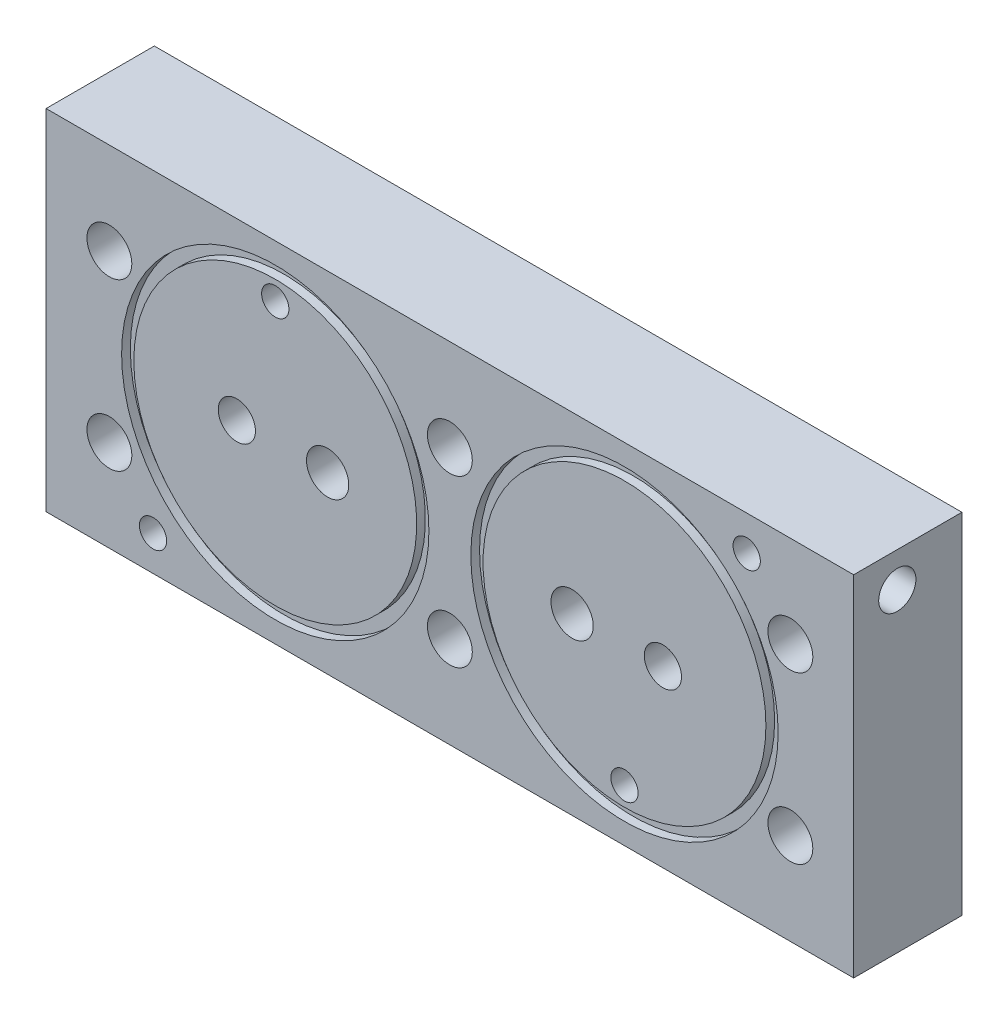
ISO-10303-21;
HEADER;
FILE_DESCRIPTION(('STEP AP214'),'2;1');
FILE_NAME('part.step','',(''),(''),'','','');
FILE_SCHEMA(('AUTOMOTIVE_DESIGN { 1 0 10303 214 1 1 1 1 }'));
ENDSEC;
DATA;
#1=APPLICATION_CONTEXT('core data for automotive mechanical design processes');
#2=APPLICATION_PROTOCOL_DEFINITION('international standard','automotive_design',2000,#1);
#3=PRODUCT_CONTEXT('',#1,'mechanical');
#4=PRODUCT('Part','Part','',(#3));
#5=PRODUCT_RELATED_PRODUCT_CATEGORY('part','',(#4));
#6=PRODUCT_DEFINITION_FORMATION('','',#4);
#7=PRODUCT_DEFINITION_CONTEXT('part definition',#1,'design');
#8=PRODUCT_DEFINITION('design','',#6,#7);
#9=PRODUCT_DEFINITION_SHAPE('','',#8);
#10=(LENGTH_UNIT() NAMED_UNIT(*) SI_UNIT(.MILLI.,.METRE.));
#11=(NAMED_UNIT(*) PLANE_ANGLE_UNIT() SI_UNIT($,.RADIAN.));
#12=(NAMED_UNIT(*) SI_UNIT($,.STERADIAN.) SOLID_ANGLE_UNIT());
#13=UNCERTAINTY_MEASURE_WITH_UNIT(LENGTH_MEASURE(1.E-05),#10,'distance_accuracy_value','');
#14=(GEOMETRIC_REPRESENTATION_CONTEXT(3) GLOBAL_UNCERTAINTY_ASSIGNED_CONTEXT((#13)) GLOBAL_UNIT_ASSIGNED_CONTEXT((#10,
#11,#12)) REPRESENTATION_CONTEXT('',''));
#15=CARTESIAN_POINT('',(0.,0.,0.));
#16=DIRECTION('',(0.,0.,1.));
#17=DIRECTION('',(1.,0.,0.));
#18=AXIS2_PLACEMENT_3D('',#15,#16,#17);
#19=CARTESIAN_POINT('',(-43.18,-20.32,7.874));
#20=DIRECTION('',(0.,0.,1.));
#21=DIRECTION('',(1.,0.,0.));
#22=AXIS2_PLACEMENT_3D('',#19,#20,#21);
#23=CYLINDRICAL_SURFACE('',#22,1.98437499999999);
#24=CARTESIAN_POINT('',(-43.18,-20.32,7.874));
#25=DIRECTION('',(0.,0.,1.));
#26=DIRECTION('',(1.,0.,0.));
#27=AXIS2_PLACEMENT_3D('',#24,#25,#26);
#28=CIRCLE('',#27,1.98437499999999);
#29=CARTESIAN_POINT('',(-41.195625,-20.32,7.874));
#30=VERTEX_POINT('',#29);
#31=EDGE_CURVE('E267',#30,#30,#28,.T.);
#32=ORIENTED_EDGE('',*,*,#31,.T.);
#33=EDGE_LOOP('',(#32));
#34=FACE_BOUND('',#33,.T.);
#35=CARTESIAN_POINT('',(-43.18,-20.32,1.524));
#36=DIRECTION('',(0.707106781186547,0.,0.707106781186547));
#37=DIRECTION('',(-0.707106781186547,0.,0.707106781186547));
#38=AXIS2_PLACEMENT_3D('',#35,#36,#37);
#39=ELLIPSE('',#38,2.80633003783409,1.98437499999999);
#40=CARTESIAN_POINT('',(-43.18,-22.304375,1.524));
#41=VERTEX_POINT('',#40);
#42=CARTESIAN_POINT('',(-43.18,-18.335625,1.524));
#43=VERTEX_POINT('',#42);
#44=EDGE_CURVE('E53',#41,#43,#39,.F.);
#45=ORIENTED_EDGE('',*,*,#44,.T.);
#46=CARTESIAN_POINT('',(-43.18,-20.32,1.524));
#47=DIRECTION('',(-0.707106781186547,0.,0.707106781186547));
#48=DIRECTION('',(0.707106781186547,0.,0.707106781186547));
#49=AXIS2_PLACEMENT_3D('',#46,#47,#48);
#50=ELLIPSE('',#49,2.80633003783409,1.98437499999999);
#51=EDGE_CURVE('E135',#43,#41,#50,.F.);
#52=ORIENTED_EDGE('',*,*,#51,.T.);
#53=EDGE_LOOP('',(#45,#52));
#54=FACE_BOUND('',#53,.T.);
#55=ADVANCED_FACE('F37',(#34,#54),#23,.F.);
#56=CARTESIAN_POINT('',(-49.53,-12.065,-7.874));
#57=DIRECTION('',(0.,0.,1.));
#58=DIRECTION('',(1.,0.,0.));
#59=AXIS2_PLACEMENT_3D('',#56,#57,#58);
#60=CYLINDRICAL_SURFACE('',#59,3.2639);
#61=CARTESIAN_POINT('',(-49.53,-12.065,7.874));
#62=DIRECTION('',(0.,0.,1.));
#63=DIRECTION('',(-1.,0.,0.));
#64=AXIS2_PLACEMENT_3D('',#61,#62,#63);
#65=CIRCLE('',#64,3.2639);
#66=CARTESIAN_POINT('',(-52.7939,-12.065,7.874));
#67=VERTEX_POINT('',#66);
#68=EDGE_CURVE('E291',#67,#67,#65,.T.);
#69=ORIENTED_EDGE('',*,*,#68,.T.);
#70=EDGE_LOOP('',(#69));
#71=FACE_BOUND('',#70,.T.);
#72=CARTESIAN_POINT('',(-49.53,-12.065,-4.572));
#73=DIRECTION('',(0.,0.,-1.));
#74=DIRECTION('',(-1.,0.,0.));
#75=AXIS2_PLACEMENT_3D('',#72,#73,#74);
#76=CIRCLE('',#75,3.2639);
#77=CARTESIAN_POINT('',(-52.7939,-12.065,-4.572));
#78=VERTEX_POINT('',#77);
#79=EDGE_CURVE('E147',#78,#78,#76,.F.);
#80=ORIENTED_EDGE('',*,*,#79,.F.);
#81=EDGE_LOOP('',(#80));
#82=FACE_BOUND('',#81,.T.);
#83=ADVANCED_FACE('F461',(#71,#82),#60,.F.);
#84=CARTESIAN_POINT('',(49.53,12.065,-7.874));
#85=DIRECTION('',(0.,0.,1.));
#86=DIRECTION('',(1.,0.,0.));
#87=AXIS2_PLACEMENT_3D('',#84,#85,#86);
#88=CYLINDRICAL_SURFACE('',#87,3.2639);
#89=CARTESIAN_POINT('',(49.53,12.065,7.874));
#90=DIRECTION('',(0.,0.,1.));
#91=DIRECTION('',(-1.,0.,0.));
#92=AXIS2_PLACEMENT_3D('',#89,#90,#91);
#93=CIRCLE('',#92,3.2639);
#94=CARTESIAN_POINT('',(46.2661,12.065,7.874));
#95=VERTEX_POINT('',#94);
#96=EDGE_CURVE('E300',#95,#95,#93,.T.);
#97=ORIENTED_EDGE('',*,*,#96,.T.);
#98=EDGE_LOOP('',(#97));
#99=FACE_BOUND('',#98,.T.);
#100=CARTESIAN_POINT('',(49.53,12.065,-4.572));
#101=DIRECTION('',(0.,0.,-1.));
#102=DIRECTION('',(-1.,0.,0.));
#103=AXIS2_PLACEMENT_3D('',#100,#101,#102);
#104=CIRCLE('',#103,3.2639);
#105=CARTESIAN_POINT('',(46.2661,12.065,-4.572));
#106=VERTEX_POINT('',#105);
#107=EDGE_CURVE('E168',#106,#106,#104,.F.);
#108=ORIENTED_EDGE('',*,*,#107,.F.);
#109=EDGE_LOOP('',(#108));
#110=FACE_BOUND('',#109,.T.);
#111=ADVANCED_FACE('F466',(#99,#110),#88,.F.);
#112=CARTESIAN_POINT('',(0.,12.065,-7.874));
#113=DIRECTION('',(0.,0.,1.));
#114=DIRECTION('',(1.,0.,0.));
#115=AXIS2_PLACEMENT_3D('',#112,#113,#114);
#116=CYLINDRICAL_SURFACE('',#115,3.2639);
#117=CARTESIAN_POINT('',(0.,12.065,7.874));
#118=DIRECTION('',(0.,0.,1.));
#119=DIRECTION('',(1.,0.,0.));
#120=AXIS2_PLACEMENT_3D('',#117,#118,#119);
#121=CIRCLE('',#120,3.2639);
#122=CARTESIAN_POINT('',(3.2639,12.065,7.874));
#123=VERTEX_POINT('',#122);
#124=EDGE_CURVE('E303',#123,#123,#121,.T.);
#125=ORIENTED_EDGE('',*,*,#124,.T.);
#126=EDGE_LOOP('',(#125));
#127=FACE_BOUND('',#126,.T.);
#128=CARTESIAN_POINT('',(0.,12.065,-4.572));
#129=DIRECTION('',(0.,0.,-1.));
#130=DIRECTION('',(-1.,0.,0.));
#131=AXIS2_PLACEMENT_3D('',#128,#129,#130);
#132=CIRCLE('',#131,3.2639);
#133=CARTESIAN_POINT('',(-3.2639,12.065,-4.572));
#134=VERTEX_POINT('',#133);
#135=EDGE_CURVE('E175',#134,#134,#132,.F.);
#136=ORIENTED_EDGE('',*,*,#135,.F.);
#137=EDGE_LOOP('',(#136));
#138=FACE_BOUND('',#137,.T.);
#139=ADVANCED_FACE('F577',(#127,#138),#116,.F.);
#140=CARTESIAN_POINT('',(43.18,20.32,7.874));
#141=DIRECTION('',(0.,0.,1.));
#142=DIRECTION('',(1.,0.,0.));
#143=AXIS2_PLACEMENT_3D('',#140,#141,#142);
#144=CYLINDRICAL_SURFACE('',#143,1.98437499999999);
#145=CARTESIAN_POINT('',(43.18,20.32,7.874));
#146=DIRECTION('',(0.,0.,1.));
#147=DIRECTION('',(1.,0.,0.));
#148=AXIS2_PLACEMENT_3D('',#145,#146,#147);
#149=CIRCLE('',#148,1.98437499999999);
#150=CARTESIAN_POINT('',(45.164375,20.32,7.874));
#151=VERTEX_POINT('',#150);
#152=EDGE_CURVE('E273',#151,#151,#149,.T.);
#153=ORIENTED_EDGE('',*,*,#152,.T.);
#154=EDGE_LOOP('',(#153));
#155=FACE_BOUND('',#154,.T.);
#156=CARTESIAN_POINT('',(43.18,20.32,1.524));
#157=DIRECTION('',(-0.707106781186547,0.,0.707106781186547));
#158=DIRECTION('',(0.707106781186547,0.,0.707106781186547));
#159=AXIS2_PLACEMENT_3D('',#156,#157,#158);
#160=ELLIPSE('',#159,2.8063300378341,1.98437499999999);
#161=CARTESIAN_POINT('',(43.18,22.304375,1.524));
#162=VERTEX_POINT('',#161);
#163=CARTESIAN_POINT('',(43.18,18.335625,1.524));
#164=VERTEX_POINT('',#163);
#165=EDGE_CURVE('E60',#162,#164,#160,.F.);
#166=ORIENTED_EDGE('',*,*,#165,.T.);
#167=CARTESIAN_POINT('',(43.18,20.32,1.524));
#168=DIRECTION('',(0.707106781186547,0.,0.707106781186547));
#169=DIRECTION('',(-0.707106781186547,0.,0.707106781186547));
#170=AXIS2_PLACEMENT_3D('',#167,#168,#169);
#171=ELLIPSE('',#170,2.8063300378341,1.98437499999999);
#172=EDGE_CURVE('E197',#164,#162,#171,.F.);
#173=ORIENTED_EDGE('',*,*,#172,.T.);
#174=EDGE_LOOP('',(#166,#173));
#175=FACE_BOUND('',#174,.T.);
#176=ADVANCED_FACE('F428',(#155,#175),#144,.F.);
#177=CARTESIAN_POINT('',(-30.988,0.,7.874));
#178=DIRECTION('',(0.,0.,1.));
#179=DIRECTION('',(1.,0.,0.));
#180=AXIS2_PLACEMENT_3D('',#177,#178,#179);
#181=CYLINDRICAL_SURFACE('',#180,2.70509999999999);
#182=CARTESIAN_POINT('',(-30.988,0.,7.874));
#183=DIRECTION('',(0.,0.,1.));
#184=DIRECTION('',(1.,0.,0.));
#185=AXIS2_PLACEMENT_3D('',#182,#183,#184);
#186=CIRCLE('',#185,2.70509999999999);
#187=CARTESIAN_POINT('',(-28.2829,0.,7.874));
#188=VERTEX_POINT('',#187);
#189=EDGE_CURVE('E261',#188,#188,#186,.T.);
#190=ORIENTED_EDGE('',*,*,#189,.T.);
#191=EDGE_LOOP('',(#190));
#192=FACE_BOUND('',#191,.T.);
#193=CARTESIAN_POINT('',(-30.988,0.,-6.604));
#194=DIRECTION('',(0.,0.,-1.));
#195=DIRECTION('',(-1.,0.,0.));
#196=AXIS2_PLACEMENT_3D('',#193,#194,#195);
#197=CIRCLE('',#196,2.70509999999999);
#198=CARTESIAN_POINT('',(-33.6931,0.,-6.604));
#199=VERTEX_POINT('',#198);
#200=EDGE_CURVE('E203',#199,#199,#197,.F.);
#201=ORIENTED_EDGE('',*,*,#200,.F.);
#202=EDGE_LOOP('',(#201));
#203=FACE_BOUND('',#202,.T.);
#204=ADVANCED_FACE('F424',(#192,#203),#181,.F.);
#205=CARTESIAN_POINT('',(30.988,0.,7.874));
#206=DIRECTION('',(0.,0.,1.));
#207=DIRECTION('',(1.,0.,0.));
#208=AXIS2_PLACEMENT_3D('',#205,#206,#207);
#209=CYLINDRICAL_SURFACE('',#208,2.70509999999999);
#210=CARTESIAN_POINT('',(30.988,0.,7.874));
#211=DIRECTION('',(0.,0.,1.));
#212=DIRECTION('',(1.,0.,0.));
#213=AXIS2_PLACEMENT_3D('',#210,#211,#212);
#214=CIRCLE('',#213,2.70509999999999);
#215=CARTESIAN_POINT('',(33.6931,0.,7.874));
#216=VERTEX_POINT('',#215);
#217=EDGE_CURVE('E264',#216,#216,#214,.T.);
#218=ORIENTED_EDGE('',*,*,#217,.T.);
#219=EDGE_LOOP('',(#218));
#220=FACE_BOUND('',#219,.T.);
#221=CARTESIAN_POINT('',(30.988,0.,-6.604));
#222=DIRECTION('',(0.,0.,-1.));
#223=DIRECTION('',(-1.,0.,0.));
#224=AXIS2_PLACEMENT_3D('',#221,#222,#223);
#225=CIRCLE('',#224,2.70509999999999);
#226=CARTESIAN_POINT('',(28.2829,0.,-6.604));
#227=VERTEX_POINT('',#226);
#228=EDGE_CURVE('E209',#227,#227,#225,.F.);
#229=ORIENTED_EDGE('',*,*,#228,.F.);
#230=EDGE_LOOP('',(#229));
#231=FACE_BOUND('',#230,.T.);
#232=ADVANCED_FACE('F427',(#220,#231),#209,.F.);
#233=CARTESIAN_POINT('',(-58.7375,25.4,7.874));
#234=DIRECTION('',(0.,0.,1.));
#235=DIRECTION('',(1.,0.,0.));
#236=AXIS2_PLACEMENT_3D('',#233,#234,#235);
#237=PLANE('',#236);
#238=CARTESIAN_POINT('',(-25.4,17.78,7.874));
#239=DIRECTION('',(0.,0.,1.));
#240=DIRECTION('',(1.,0.,0.));
#241=AXIS2_PLACEMENT_3D('',#238,#239,#240);
#242=CIRCLE('',#241,1.98437499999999);
#243=CARTESIAN_POINT('',(-23.415625,17.78,7.874));
#244=VERTEX_POINT('',#243);
#245=EDGE_CURVE('E282',#244,#244,#242,.T.);
#246=ORIENTED_EDGE('',*,*,#245,.F.);
#247=EDGE_LOOP('',(#246));
#248=FACE_BOUND('',#247,.T.);
#249=ORIENTED_EDGE('',*,*,#189,.F.);
#250=EDGE_LOOP('',(#249));
#251=FACE_BOUND('',#250,.T.);
#252=CARTESIAN_POINT('',(-17.78,0.,7.874));
#253=DIRECTION('',(0.,0.,-1.));
#254=DIRECTION('',(-1.,0.,0.));
#255=AXIS2_PLACEMENT_3D('',#252,#253,#254);
#256=CIRCLE('',#255,3.0734);
#257=CARTESIAN_POINT('',(-20.8534,0.,7.874));
#258=VERTEX_POINT('',#257);
#259=EDGE_CURVE('E258',#258,#258,#256,.T.);
#260=ORIENTED_EDGE('',*,*,#259,.T.);
#261=EDGE_LOOP('',(#260));
#262=FACE_BOUND('',#261,.T.);
#263=CARTESIAN_POINT('',(-25.4,0.,7.874));
#264=DIRECTION('',(0.,0.,1.));
#265=DIRECTION('',(-1.,0.,0.));
#266=AXIS2_PLACEMENT_3D('',#263,#264,#265);
#267=CIRCLE('',#266,20.574);
#268=CARTESIAN_POINT('',(-45.974,0.,7.874));
#269=VERTEX_POINT('',#268);
#270=EDGE_CURVE('E217',#269,#269,#267,.T.);
#271=ORIENTED_EDGE('',*,*,#270,.T.);
#272=EDGE_LOOP('',(#271));
#273=FACE_BOUND('',#272,.T.);
#274=ADVANCED_FACE('F432',(#248,#251,#262,#273),#237,.T.);
#275=CARTESIAN_POINT('',(25.4,-17.78,7.874));
#276=DIRECTION('',(0.,0.,1.));
#277=DIRECTION('',(1.,0.,0.));
#278=AXIS2_PLACEMENT_3D('',#275,#276,#277);
#279=CIRCLE('',#278,1.98437499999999);
#280=CARTESIAN_POINT('',(27.384375,-17.78,7.874));
#281=VERTEX_POINT('',#280);
#282=EDGE_CURVE('E288',#281,#281,#279,.T.);
#283=ORIENTED_EDGE('',*,*,#282,.F.);
#284=EDGE_LOOP('',(#283));
#285=FACE_BOUND('',#284,.T.);
#286=ORIENTED_EDGE('',*,*,#217,.F.);
#287=EDGE_LOOP('',(#286));
#288=FACE_BOUND('',#287,.T.);
#289=CARTESIAN_POINT('',(17.78,0.,7.874));
#290=DIRECTION('',(0.,0.,-1.));
#291=DIRECTION('',(-1.,0.,0.));
#292=AXIS2_PLACEMENT_3D('',#289,#290,#291);
#293=CIRCLE('',#292,3.0734);
#294=CARTESIAN_POINT('',(14.7066,0.,7.874));
#295=VERTEX_POINT('',#294);
#296=EDGE_CURVE('E246',#295,#295,#293,.T.);
#297=ORIENTED_EDGE('',*,*,#296,.T.);
#298=EDGE_LOOP('',(#297));
#299=FACE_BOUND('',#298,.T.);
#300=CARTESIAN_POINT('',(25.4,0.,7.874));
#301=DIRECTION('',(0.,0.,1.));
#302=DIRECTION('',(1.,0.,0.));
#303=AXIS2_PLACEMENT_3D('',#300,#301,#302);
#304=CIRCLE('',#303,20.574);
#305=CARTESIAN_POINT('',(45.974,0.,7.874));
#306=VERTEX_POINT('',#305);
#307=EDGE_CURVE('E223',#306,#306,#304,.T.);
#308=ORIENTED_EDGE('',*,*,#307,.T.);
#309=EDGE_LOOP('',(#308));
#310=FACE_BOUND('',#309,.T.);
#311=ADVANCED_FACE('F478',(#285,#288,#299,#310),#237,.T.);
#312=CARTESIAN_POINT('',(-58.7375,25.4,7.874));
#313=DIRECTION('',(1.,0.,0.));
#314=DIRECTION('',(0.,1.,0.));
#315=AXIS2_PLACEMENT_3D('',#312,#313,#314);
#316=PLANE('',#315);
#317=CARTESIAN_POINT('',(-58.7375,-20.32,1.524));
#318=DIRECTION('',(-1.,0.,0.));
#319=DIRECTION('',(0.,0.,1.));
#320=AXIS2_PLACEMENT_3D('',#317,#318,#319);
#321=CIRCLE('',#320,2.70509999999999);
#322=CARTESIAN_POINT('',(-58.7375,-20.32,4.22909999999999));
#323=VERTEX_POINT('',#322);
#324=EDGE_CURVE('E124',#323,#323,#321,.T.);
#325=ORIENTED_EDGE('',*,*,#324,.F.);
#326=EDGE_LOOP('',(#325));
#327=FACE_BOUND('',#326,.T.);
#328=DIRECTION('',(0.,-1.,0.));
#329=VECTOR('',#328,1.);
#330=CARTESIAN_POINT('',(-58.7375,25.4,-7.874));
#331=LINE('',#330,#329);
#332=CARTESIAN_POINT('',(-58.7375,25.4,-7.874));
#333=VERTEX_POINT('',#332);
#334=CARTESIAN_POINT('',(-58.7375,-25.4,-7.874));
#335=VERTEX_POINT('',#334);
#336=EDGE_CURVE('E309',#333,#335,#331,.T.);
#337=ORIENTED_EDGE('',*,*,#336,.T.);
#338=DIRECTION('',(0.,0.,-1.));
#339=VECTOR('',#338,1.);
#340=CARTESIAN_POINT('',(-58.7375,-25.4,7.874));
#341=LINE('',#340,#339);
#342=CARTESIAN_POINT('',(-58.7375,-25.4,7.874));
#343=VERTEX_POINT('',#342);
#344=EDGE_CURVE('E11',#343,#335,#341,.T.);
#345=ORIENTED_EDGE('',*,*,#344,.F.);
#346=DIRECTION('',(0.,-1.,0.));
#347=VECTOR('',#346,1.);
#348=CARTESIAN_POINT('',(-58.7375,25.4,7.874));
#349=LINE('',#348,#347);
#350=CARTESIAN_POINT('',(-58.7375,25.4,7.874));
#351=VERTEX_POINT('',#350);
#352=EDGE_CURVE('E310',#351,#343,#349,.T.);
#353=ORIENTED_EDGE('',*,*,#352,.F.);
#354=DIRECTION('',(0.,0.,-1.));
#355=VECTOR('',#354,1.);
#356=CARTESIAN_POINT('',(-58.7375,25.4,7.874));
#357=LINE('',#356,#355);
#358=EDGE_CURVE('E320',#351,#333,#357,.T.);
#359=ORIENTED_EDGE('',*,*,#358,.T.);
#360=EDGE_LOOP('',(#337,#345,#353,#359));
#361=FACE_BOUND('',#360,.T.);
#362=ADVANCED_FACE('F39',(#327,#361),#316,.F.);
#363=CARTESIAN_POINT('',(-58.7375,-25.4,7.874));
#364=DIRECTION('',(0.,1.,0.));
#365=DIRECTION('',(0.,0.,1.));
#366=AXIS2_PLACEMENT_3D('',#363,#364,#365);
#367=PLANE('',#366);
#368=DIRECTION('',(1.,0.,0.));
#369=VECTOR('',#368,1.);
#370=CARTESIAN_POINT('',(-58.7375,-25.4,-7.874));
#371=LINE('',#370,#369);
#372=CARTESIAN_POINT('',(58.7375,-25.4,-7.874));
#373=VERTEX_POINT('',#372);
#374=EDGE_CURVE('E323',#335,#373,#371,.T.);
#375=ORIENTED_EDGE('',*,*,#374,.T.);
#376=DIRECTION('',(0.,0.,-1.));
#377=VECTOR('',#376,1.);
#378=CARTESIAN_POINT('',(58.7375,-25.4,7.874));
#379=LINE('',#378,#377);
#380=CARTESIAN_POINT('',(58.7375,-25.4,7.874));
#381=VERTEX_POINT('',#380);
#382=EDGE_CURVE('E46',#381,#373,#379,.T.);
#383=ORIENTED_EDGE('',*,*,#382,.F.);
#384=DIRECTION('',(1.,0.,0.));
#385=VECTOR('',#384,1.);
#386=CARTESIAN_POINT('',(-58.7375,-25.4,7.874));
#387=LINE('',#386,#385);
#388=EDGE_CURVE('E313',#343,#381,#387,.T.);
#389=ORIENTED_EDGE('',*,*,#388,.F.);
#390=ORIENTED_EDGE('',*,*,#344,.T.);
#391=EDGE_LOOP('',(#375,#383,#389,#390));
#392=FACE_BOUND('',#391,.T.);
#393=ADVANCED_FACE('F501',(#392),#367,.F.);
#394=CARTESIAN_POINT('',(58.7375,25.4,7.874));
#395=DIRECTION('',(-1.,0.,0.));
#396=DIRECTION('',(0.,-1.,0.));
#397=AXIS2_PLACEMENT_3D('',#394,#395,#396);
#398=PLANE('',#397);
#399=CARTESIAN_POINT('',(58.7375,20.32,1.524));
#400=DIRECTION('',(1.,0.,0.));
#401=DIRECTION('',(0.,0.,-1.));
#402=AXIS2_PLACEMENT_3D('',#399,#400,#401);
#403=CIRCLE('',#402,2.70509999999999);
#404=CARTESIAN_POINT('',(58.7375,20.32,-1.18109999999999));
#405=VERTEX_POINT('',#404);
#406=EDGE_CURVE('E182',#405,#405,#403,.T.);
#407=ORIENTED_EDGE('',*,*,#406,.F.);
#408=EDGE_LOOP('',(#407));
#409=FACE_BOUND('',#408,.T.);
#410=DIRECTION('',(0.,1.,0.));
#411=VECTOR('',#410,1.);
#412=CARTESIAN_POINT('',(58.7375,25.4,-7.874));
#413=LINE('',#412,#411);
#414=CARTESIAN_POINT('',(58.7375,25.4,-7.874));
#415=VERTEX_POINT('',#414);
#416=EDGE_CURVE('E325',#373,#415,#413,.T.);
#417=ORIENTED_EDGE('',*,*,#416,.T.);
#418=DIRECTION('',(0.,0.,-1.));
#419=VECTOR('',#418,1.);
#420=CARTESIAN_POINT('',(58.7375,25.4,7.874));
#421=LINE('',#420,#419);
#422=CARTESIAN_POINT('',(58.7375,25.4,7.874));
#423=VERTEX_POINT('',#422);
#424=EDGE_CURVE('E330',#423,#415,#421,.T.);
#425=ORIENTED_EDGE('',*,*,#424,.F.);
#426=DIRECTION('',(0.,1.,0.));
#427=VECTOR('',#426,1.);
#428=CARTESIAN_POINT('',(58.7375,25.4,7.874));
#429=LINE('',#428,#427);
#430=EDGE_CURVE('E316',#381,#423,#429,.T.);
#431=ORIENTED_EDGE('',*,*,#430,.F.);
#432=ORIENTED_EDGE('',*,*,#382,.T.);
#433=EDGE_LOOP('',(#417,#425,#431,#432));
#434=FACE_BOUND('',#433,.T.);
#435=ADVANCED_FACE('F506',(#409,#434),#398,.F.);
#436=CARTESIAN_POINT('',(-58.7375,25.4,7.874));
#437=DIRECTION('',(0.,-1.,0.));
#438=DIRECTION('',(1.,0.,0.));
#439=AXIS2_PLACEMENT_3D('',#436,#437,#438);
#440=PLANE('',#439);
#441=DIRECTION('',(-1.,0.,0.));
#442=VECTOR('',#441,1.);
#443=CARTESIAN_POINT('',(-58.7375,25.4,-7.874));
#444=LINE('',#443,#442);
#445=EDGE_CURVE('E314',#415,#333,#444,.T.);
#446=ORIENTED_EDGE('',*,*,#445,.T.);
#447=ORIENTED_EDGE('',*,*,#358,.F.);
#448=DIRECTION('',(-1.,0.,0.));
#449=VECTOR('',#448,1.);
#450=CARTESIAN_POINT('',(-58.7375,25.4,7.874));
#451=LINE('',#450,#449);
#452=EDGE_CURVE('E318',#423,#351,#451,.T.);
#453=ORIENTED_EDGE('',*,*,#452,.F.);
#454=ORIENTED_EDGE('',*,*,#424,.T.);
#455=EDGE_LOOP('',(#446,#447,#453,#454));
#456=FACE_BOUND('',#455,.T.);
#457=ADVANCED_FACE('F475',(#456),#440,.F.);
#458=CARTESIAN_POINT('',(-25.4,0.,7.874));
#459=DIRECTION('',(0.,0.,1.));
#460=DIRECTION('',(-1.,0.,0.));
#461=AXIS2_PLACEMENT_3D('',#458,#459,#460);
#462=CIRCLE('',#461,22.352);
#463=CARTESIAN_POINT('',(-47.752,0.,7.874));
#464=VERTEX_POINT('',#463);
#465=EDGE_CURVE('E216',#464,#464,#462,.T.);
#466=ORIENTED_EDGE('',*,*,#465,.F.);
#467=EDGE_LOOP('',(#466));
#468=FACE_BOUND('',#467,.T.);
#469=CARTESIAN_POINT('',(25.4,0.,7.874));
#470=DIRECTION('',(0.,0.,1.));
#471=DIRECTION('',(1.,0.,0.));
#472=AXIS2_PLACEMENT_3D('',#469,#470,#471);
#473=CIRCLE('',#472,22.352);
#474=CARTESIAN_POINT('',(47.752,0.,7.874));
#475=VERTEX_POINT('',#474);
#476=EDGE_CURVE('E229',#475,#475,#473,.T.);
#477=ORIENTED_EDGE('',*,*,#476,.F.);
#478=EDGE_LOOP('',(#477));
#479=FACE_BOUND('',#478,.T.);
#480=ORIENTED_EDGE('',*,*,#31,.F.);
#481=EDGE_LOOP('',(#480));
#482=FACE_BOUND('',#481,.T.);
#483=ORIENTED_EDGE('',*,*,#152,.F.);
#484=EDGE_LOOP('',(#483));
#485=FACE_BOUND('',#484,.T.);
#486=ORIENTED_EDGE('',*,*,#68,.F.);
#487=EDGE_LOOP('',(#486));
#488=FACE_BOUND('',#487,.T.);
#489=CARTESIAN_POINT('',(0.,-12.065,7.874));
#490=DIRECTION('',(0.,0.,1.));
#491=DIRECTION('',(-1.,0.,0.));
#492=AXIS2_PLACEMENT_3D('',#489,#490,#491);
#493=CIRCLE('',#492,3.2639);
#494=CARTESIAN_POINT('',(-3.2639,-12.065,7.874));
#495=VERTEX_POINT('',#494);
#496=EDGE_CURVE('E294',#495,#495,#493,.T.);
#497=ORIENTED_EDGE('',*,*,#496,.F.);
#498=EDGE_LOOP('',(#497));
#499=FACE_BOUND('',#498,.T.);
#500=CARTESIAN_POINT('',(49.53,-12.065,7.874));
#501=DIRECTION('',(0.,0.,1.));
#502=DIRECTION('',(1.,0.,0.));
#503=AXIS2_PLACEMENT_3D('',#500,#501,#502);
#504=CIRCLE('',#503,3.2639);
#505=CARTESIAN_POINT('',(52.7939,-12.065,7.874));
#506=VERTEX_POINT('',#505);
#507=EDGE_CURVE('E297',#506,#506,#504,.T.);
#508=ORIENTED_EDGE('',*,*,#507,.F.);
#509=EDGE_LOOP('',(#508));
#510=FACE_BOUND('',#509,.T.);
#511=ORIENTED_EDGE('',*,*,#96,.F.);
#512=EDGE_LOOP('',(#511));
#513=FACE_BOUND('',#512,.T.);
#514=ORIENTED_EDGE('',*,*,#124,.F.);
#515=EDGE_LOOP('',(#514));
#516=FACE_BOUND('',#515,.T.);
#517=CARTESIAN_POINT('',(-49.53,12.065,7.874));
#518=DIRECTION('',(0.,0.,1.));
#519=DIRECTION('',(1.,0.,0.));
#520=AXIS2_PLACEMENT_3D('',#517,#518,#519);
#521=CIRCLE('',#520,3.2639);
#522=CARTESIAN_POINT('',(-46.2661,12.065,7.874));
#523=VERTEX_POINT('',#522);
#524=EDGE_CURVE('E306',#523,#523,#521,.T.);
#525=ORIENTED_EDGE('',*,*,#524,.F.);
#526=EDGE_LOOP('',(#525));
#527=FACE_BOUND('',#526,.T.);
#528=ORIENTED_EDGE('',*,*,#352,.T.);
#529=ORIENTED_EDGE('',*,*,#388,.T.);
#530=ORIENTED_EDGE('',*,*,#430,.T.);
#531=ORIENTED_EDGE('',*,*,#452,.T.);
#532=EDGE_LOOP('',(#528,#529,#530,#531));
#533=FACE_BOUND('',#532,.T.);
#534=ADVANCED_FACE('F471',(#468,#479,#482,#485,#488,#499,#510,#513,#516,#527,#533),#237,.T.);
#535=CARTESIAN_POINT('',(-58.7375,25.4,-7.874));
#536=DIRECTION('',(0.,0.,1.));
#537=DIRECTION('',(1.,0.,0.));
#538=AXIS2_PLACEMENT_3D('',#535,#536,#537);
#539=PLANE('',#538);
#540=CARTESIAN_POINT('',(0.,-12.065,-7.874));
#541=DIRECTION('',(0.,0.,-1.));
#542=DIRECTION('',(1.,0.,0.));
#543=AXIS2_PLACEMENT_3D('',#540,#541,#542);
#544=CIRCLE('',#543,4.7625);
#545=CARTESIAN_POINT('',(-4.7625,-12.065,-7.874));
#546=VERTEX_POINT('',#545);
#547=EDGE_CURVE('E137',#546,#546,#544,.T.);
#548=ORIENTED_EDGE('',*,*,#547,.F.);
#549=EDGE_LOOP('',(#548));
#550=FACE_BOUND('',#549,.T.);
#551=CARTESIAN_POINT('',(-49.53,-12.065,-7.874));
#552=DIRECTION('',(0.,0.,-1.));
#553=DIRECTION('',(-1.,0.,0.));
#554=AXIS2_PLACEMENT_3D('',#551,#552,#553);
#555=CIRCLE('',#554,4.7625);
#556=CARTESIAN_POINT('',(-54.2925,-12.065,-7.874));
#557=VERTEX_POINT('',#556);
#558=EDGE_CURVE('E148',#557,#557,#555,.T.);
#559=ORIENTED_EDGE('',*,*,#558,.F.);
#560=EDGE_LOOP('',(#559));
#561=FACE_BOUND('',#560,.T.);
#562=CARTESIAN_POINT('',(49.53,-12.065,-7.874));
#563=DIRECTION('',(0.,0.,-1.));
#564=DIRECTION('',(1.,0.,0.));
#565=AXIS2_PLACEMENT_3D('',#562,#563,#564);
#566=CIRCLE('',#565,4.7625);
#567=CARTESIAN_POINT('',(44.7675,-12.065,-7.874));
#568=VERTEX_POINT('',#567);
#569=EDGE_CURVE('E155',#568,#568,#566,.T.);
#570=ORIENTED_EDGE('',*,*,#569,.F.);
#571=EDGE_LOOP('',(#570));
#572=FACE_BOUND('',#571,.T.);
#573=CARTESIAN_POINT('',(-49.53,12.065,-7.874));
#574=DIRECTION('',(0.,0.,-1.));
#575=DIRECTION('',(1.,0.,0.));
#576=AXIS2_PLACEMENT_3D('',#573,#574,#575);
#577=CIRCLE('',#576,4.7625);
#578=CARTESIAN_POINT('',(-54.2925,12.065,-7.874));
#579=VERTEX_POINT('',#578);
#580=EDGE_CURVE('E162',#579,#579,#577,.T.);
#581=ORIENTED_EDGE('',*,*,#580,.F.);
#582=EDGE_LOOP('',(#581));
#583=FACE_BOUND('',#582,.T.);
#584=CARTESIAN_POINT('',(49.53,12.065,-7.874));
#585=DIRECTION('',(0.,0.,-1.));
#586=DIRECTION('',(-1.,0.,0.));
#587=AXIS2_PLACEMENT_3D('',#584,#585,#586);
#588=CIRCLE('',#587,4.7625);
#589=CARTESIAN_POINT('',(44.7675,12.065,-7.874));
#590=VERTEX_POINT('',#589);
#591=EDGE_CURVE('E169',#590,#590,#588,.T.);
#592=ORIENTED_EDGE('',*,*,#591,.F.);
#593=EDGE_LOOP('',(#592));
#594=FACE_BOUND('',#593,.T.);
#595=CARTESIAN_POINT('',(0.,12.065,-7.874));
#596=DIRECTION('',(0.,0.,-1.));
#597=DIRECTION('',(-1.,0.,0.));
#598=AXIS2_PLACEMENT_3D('',#595,#596,#597);
#599=CIRCLE('',#598,4.7625);
#600=CARTESIAN_POINT('',(-4.7625,12.065,-7.874));
#601=VERTEX_POINT('',#600);
#602=EDGE_CURVE('E176',#601,#601,#599,.T.);
#603=ORIENTED_EDGE('',*,*,#602,.F.);
#604=EDGE_LOOP('',(#603));
#605=FACE_BOUND('',#604,.T.);
#606=CARTESIAN_POINT('',(-30.988,0.,-7.874));
#607=DIRECTION('',(0.,0.,-1.));
#608=DIRECTION('',(-1.,0.,0.));
#609=AXIS2_PLACEMENT_3D('',#606,#607,#608);
#610=CIRCLE('',#609,6.7437);
#611=CARTESIAN_POINT('',(-37.7317,0.,-7.874));
#612=VERTEX_POINT('',#611);
#613=EDGE_CURVE('E199',#612,#612,#610,.T.);
#614=ORIENTED_EDGE('',*,*,#613,.F.);
#615=EDGE_LOOP('',(#614));
#616=FACE_BOUND('',#615,.T.);
#617=CARTESIAN_POINT('',(30.988,0.,-7.874));
#618=DIRECTION('',(0.,0.,-1.));
#619=DIRECTION('',(-1.,0.,0.));
#620=AXIS2_PLACEMENT_3D('',#617,#618,#619);
#621=CIRCLE('',#620,6.7437);
#622=CARTESIAN_POINT('',(24.2443,0.,-7.874));
#623=VERTEX_POINT('',#622);
#624=EDGE_CURVE('E210',#623,#623,#621,.T.);
#625=ORIENTED_EDGE('',*,*,#624,.F.);
#626=EDGE_LOOP('',(#625));
#627=FACE_BOUND('',#626,.T.);
#628=CARTESIAN_POINT('',(17.78,0.,-7.874));
#629=DIRECTION('',(0.,0.,-1.));
#630=DIRECTION('',(-1.,0.,0.));
#631=AXIS2_PLACEMENT_3D('',#628,#629,#630);
#632=CIRCLE('',#631,3.570986);
#633=CARTESIAN_POINT('',(14.209014,0.,-7.874));
#634=VERTEX_POINT('',#633);
#635=EDGE_CURVE('E235',#634,#634,#632,.T.);
#636=ORIENTED_EDGE('',*,*,#635,.F.);
#637=EDGE_LOOP('',(#636));
#638=FACE_BOUND('',#637,.T.);
#639=CARTESIAN_POINT('',(-17.78,0.,-7.874));
#640=DIRECTION('',(0.,0.,-1.));
#641=DIRECTION('',(-1.,0.,0.));
#642=AXIS2_PLACEMENT_3D('',#639,#640,#641);
#643=CIRCLE('',#642,3.570986);
#644=CARTESIAN_POINT('',(-21.350986,0.,-7.874));
#645=VERTEX_POINT('',#644);
#646=EDGE_CURVE('E249',#645,#645,#643,.T.);
#647=ORIENTED_EDGE('',*,*,#646,.F.);
#648=EDGE_LOOP('',(#647));
#649=FACE_BOUND('',#648,.T.);
#650=ORIENTED_EDGE('',*,*,#336,.F.);
#651=ORIENTED_EDGE('',*,*,#445,.F.);
#652=ORIENTED_EDGE('',*,*,#416,.F.);
#653=ORIENTED_EDGE('',*,*,#374,.F.);
#654=EDGE_LOOP('',(#650,#651,#652,#653));
#655=FACE_BOUND('',#654,.T.);
#656=ADVANCED_FACE('F474',(#550,#561,#572,#583,#594,#605,#616,#627,#638,#649,#655),#539,.F.);
#657=CARTESIAN_POINT('',(-49.53,12.065,-7.874));
#658=DIRECTION('',(0.,0.,1.));
#659=DIRECTION('',(1.,0.,0.));
#660=AXIS2_PLACEMENT_3D('',#657,#658,#659);
#661=CYLINDRICAL_SURFACE('',#660,3.2639);
#662=CARTESIAN_POINT('',(-49.53,12.065,-4.572));
#663=DIRECTION('',(0.,0.,1.));
#664=DIRECTION('',(1.,0.,0.));
#665=AXIS2_PLACEMENT_3D('',#662,#663,#664);
#666=CIRCLE('',#665,3.2639);
#667=CARTESIAN_POINT('',(-46.2661,12.065,-4.572));
#668=VERTEX_POINT('',#667);
#669=EDGE_CURVE('E161',#668,#668,#666,.F.);
#670=ORIENTED_EDGE('',*,*,#669,.T.);
#671=EDGE_LOOP('',(#670));
#672=FACE_BOUND('',#671,.T.);
#673=ORIENTED_EDGE('',*,*,#524,.T.);
#674=EDGE_LOOP('',(#673));
#675=FACE_BOUND('',#674,.T.);
#676=ADVANCED_FACE('F511',(#672,#675),#661,.F.);
#677=CARTESIAN_POINT('',(49.53,-12.065,-7.874));
#678=DIRECTION('',(0.,0.,1.));
#679=DIRECTION('',(1.,0.,0.));
#680=AXIS2_PLACEMENT_3D('',#677,#678,#679);
#681=CYLINDRICAL_SURFACE('',#680,3.2639);
#682=CARTESIAN_POINT('',(49.53,-12.065,-4.572));
#683=DIRECTION('',(0.,0.,1.));
#684=DIRECTION('',(1.,0.,0.));
#685=AXIS2_PLACEMENT_3D('',#682,#683,#684);
#686=CIRCLE('',#685,3.2639);
#687=CARTESIAN_POINT('',(52.7939,-12.065,-4.572));
#688=VERTEX_POINT('',#687);
#689=EDGE_CURVE('E154',#688,#688,#686,.F.);
#690=ORIENTED_EDGE('',*,*,#689,.T.);
#691=EDGE_LOOP('',(#690));
#692=FACE_BOUND('',#691,.T.);
#693=ORIENTED_EDGE('',*,*,#507,.T.);
#694=EDGE_LOOP('',(#693));
#695=FACE_BOUND('',#694,.T.);
#696=ADVANCED_FACE('F517',(#692,#695),#681,.F.);
#697=CARTESIAN_POINT('',(0.,-12.065,-7.874));
#698=DIRECTION('',(0.,0.,1.));
#699=DIRECTION('',(1.,0.,0.));
#700=AXIS2_PLACEMENT_3D('',#697,#698,#699);
#701=CYLINDRICAL_SURFACE('',#700,3.2639);
#702=CARTESIAN_POINT('',(0.,-12.065,-4.572));
#703=DIRECTION('',(0.,0.,1.));
#704=DIRECTION('',(1.,0.,0.));
#705=AXIS2_PLACEMENT_3D('',#702,#703,#704);
#706=CIRCLE('',#705,3.2639);
#707=CARTESIAN_POINT('',(3.2639,-12.065,-4.572));
#708=VERTEX_POINT('',#707);
#709=EDGE_CURVE('E141',#708,#708,#706,.F.);
#710=ORIENTED_EDGE('',*,*,#709,.T.);
#711=EDGE_LOOP('',(#710));
#712=FACE_BOUND('',#711,.T.);
#713=ORIENTED_EDGE('',*,*,#496,.T.);
#714=EDGE_LOOP('',(#713));
#715=FACE_BOUND('',#714,.T.);
#716=ADVANCED_FACE('F566',(#712,#715),#701,.F.);
#717=CARTESIAN_POINT('',(25.4,-17.78,7.874));
#718=DIRECTION('',(0.,0.,1.));
#719=DIRECTION('',(1.,0.,0.));
#720=AXIS2_PLACEMENT_3D('',#717,#718,#719);
#721=CYLINDRICAL_SURFACE('',#720,1.98437499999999);
#722=CARTESIAN_POINT('',(25.4,-19.764375,-0.380999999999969));
#723=CARTESIAN_POINT('',(25.5037569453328,-19.764370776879,-0.381005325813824));
#724=CARTESIAN_POINT('',(25.6075706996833,-19.7562092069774,-0.378676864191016));
#725=CARTESIAN_POINT('',(25.8125016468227,-19.7238018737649,-0.368768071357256));
#726=CARTESIAN_POINT('',(25.9136157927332,-19.6995386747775,-0.361182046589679));
#727=CARTESIAN_POINT('',(26.1104128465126,-19.6357401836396,-0.338974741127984));
#728=CARTESIAN_POINT('',(26.2060821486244,-19.5961684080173,-0.324336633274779));
#729=CARTESIAN_POINT('',(26.3885509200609,-19.5036435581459,-0.285367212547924));
#730=CARTESIAN_POINT('',(26.4753580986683,-19.4507022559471,-0.261044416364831));
#731=CARTESIAN_POINT('',(26.6328179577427,-19.3378155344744,-0.201369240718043));
#732=CARTESIAN_POINT('',(26.7040787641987,-19.278382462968,-0.166661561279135));
#733=CARTESIAN_POINT('',(26.8336939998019,-19.1548695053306,-0.0840108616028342));
#734=CARTESIAN_POINT('',(26.8920605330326,-19.0907940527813,-0.0360803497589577));
#735=CARTESIAN_POINT('',(26.9895224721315,-18.9701844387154,0.0675085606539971));
#736=CARTESIAN_POINT('',(27.0300150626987,-18.9135800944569,0.121782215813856));
#737=CARTESIAN_POINT('',(27.1006493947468,-18.8045790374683,0.240361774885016));
#738=CARTESIAN_POINT('',(27.1307884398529,-18.752183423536,0.30467028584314));
#739=CARTESIAN_POINT('',(27.1820538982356,-18.6546829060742,0.441629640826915));
#740=CARTESIAN_POINT('',(27.2031931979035,-18.6095676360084,0.514268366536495));
#741=CARTESIAN_POINT('',(27.2382955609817,-18.5285756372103,0.666119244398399));
#742=CARTESIAN_POINT('',(27.2522559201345,-18.4927023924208,0.745333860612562));
#743=CARTESIAN_POINT('',(27.27582833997,-18.4283184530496,0.916934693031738));
#744=CARTESIAN_POINT('',(27.2848393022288,-18.4009571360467,1.00983493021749));
#745=CARTESIAN_POINT('',(27.2978321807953,-18.3600312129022,1.19897189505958));
#746=CARTESIAN_POINT('',(27.3018119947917,-18.3464723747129,1.2952100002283));
#747=CARTESIAN_POINT('',(27.3057701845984,-18.3330348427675,1.49678731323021));
#748=CARTESIAN_POINT('',(27.305388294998,-18.3343874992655,1.60221785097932));
#749=CARTESIAN_POINT('',(27.2996475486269,-18.3537431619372,1.81143949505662));
#750=CARTESIAN_POINT('',(27.2942868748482,-18.3717522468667,1.91522998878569));
#751=CARTESIAN_POINT('',(27.2771079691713,-18.4241917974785,2.11979217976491));
#752=CARTESIAN_POINT('',(27.2651906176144,-18.4588732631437,2.22049183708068));
#753=CARTESIAN_POINT('',(27.2322955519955,-18.5431990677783,2.4138432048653));
#754=CARTESIAN_POINT('',(27.2113226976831,-18.5928353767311,2.50649920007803));
#755=CARTESIAN_POINT('',(27.158677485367,-18.7009724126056,2.6755130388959));
#756=CARTESIAN_POINT('',(27.1276728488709,-18.7588180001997,2.7524942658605));
#757=CARTESIAN_POINT('',(27.0524163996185,-18.8810794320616,2.89365145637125));
#758=CARTESIAN_POINT('',(27.0081810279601,-18.9454870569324,2.95784314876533));
#759=CARTESIAN_POINT('',(26.9112222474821,-19.0681605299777,3.06561247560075));
#760=CARTESIAN_POINT('',(26.8600072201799,-19.1263050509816,3.11069462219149));
#761=CARTESIAN_POINT('',(26.7468193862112,-19.2395283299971,3.18986479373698));
#762=CARTESIAN_POINT('',(26.6848447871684,-19.2946065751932,3.22395098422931));
#763=CARTESIAN_POINT('',(26.5533653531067,-19.3968647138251,3.2815356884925));
#764=CARTESIAN_POINT('',(26.4841038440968,-19.4442153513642,3.30529104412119));
#765=CARTESIAN_POINT('',(26.3384985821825,-19.5304670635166,3.34516560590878));
#766=CARTESIAN_POINT('',(26.2621522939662,-19.569365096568,3.36128206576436));
#767=CARTESIAN_POINT('',(26.0967370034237,-19.640416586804,3.3888073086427));
#768=CARTESIAN_POINT('',(26.0071475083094,-19.6715852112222,3.39962723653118));
#769=CARTESIAN_POINT('',(25.8239819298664,-19.7208746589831,3.41594760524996));
#770=CARTESIAN_POINT('',(25.7304041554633,-19.7389898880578,3.42144576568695));
#771=CARTESIAN_POINT('',(25.5326280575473,-19.7626664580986,3.42854758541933));
#772=CARTESIAN_POINT('',(25.4282532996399,-19.766899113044,3.42974011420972));
#773=CARTESIAN_POINT('',(25.2201693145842,-19.7589552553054,3.4274141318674));
#774=CARTESIAN_POINT('',(25.116460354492,-19.746772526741,3.42389383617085));
#775=CARTESIAN_POINT('',(24.9097456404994,-19.7058134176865,3.41106075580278));
#776=CARTESIAN_POINT('',(24.8068325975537,-19.6766026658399,3.40159581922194));
#777=CARTESIAN_POINT('',(24.6577504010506,-19.6210981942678,3.38132422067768));
#778=CARTESIAN_POINT('',(24.6089137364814,-19.6006350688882,3.37354907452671));
#779=CARTESIAN_POINT('',(24.5133958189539,-19.5560761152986,3.3555962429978));
#780=CARTESIAN_POINT('',(24.4667134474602,-19.5319822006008,3.34541982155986));
#781=CARTESIAN_POINT('',(24.3778106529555,-19.4815804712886,3.32275692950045));
#782=CARTESIAN_POINT('',(24.3354854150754,-19.4554063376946,3.31038408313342));
#783=CARTESIAN_POINT('',(24.2535831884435,-19.4004636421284,3.28273321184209));
#784=CARTESIAN_POINT('',(24.2140047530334,-19.3716964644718,3.26745673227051));
#785=CARTESIAN_POINT('',(24.1379494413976,-19.3120910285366,3.23368809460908));
#786=CARTESIAN_POINT('',(24.1014698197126,-19.2812546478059,3.21519882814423));
#787=CARTESIAN_POINT('',(24.0318735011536,-19.2181192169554,3.17476112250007));
#788=CARTESIAN_POINT('',(23.9987563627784,-19.1858203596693,3.1528131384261));
#789=CARTESIAN_POINT('',(23.9117086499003,-19.0949838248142,3.08675930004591));
#790=CARTESIAN_POINT('',(23.8616026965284,-19.035560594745,3.03868853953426));
#791=CARTESIAN_POINT('',(23.7730554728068,-18.9185128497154,2.93108747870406));
#792=CARTESIAN_POINT('',(23.7346141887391,-18.8608883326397,2.87155719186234));
#793=CARTESIAN_POINT('',(23.6700842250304,-18.7540844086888,2.74552906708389));
#794=CARTESIAN_POINT('',(23.6434712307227,-18.7046259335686,2.67953267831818));
#795=CARTESIAN_POINT('',(23.5983768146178,-18.6133647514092,2.53992551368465));
#796=CARTESIAN_POINT('',(23.5798982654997,-18.5715647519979,2.4663120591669));
#797=CARTESIAN_POINT('',(23.5481522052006,-18.4943486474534,2.30706582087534));
#798=CARTESIAN_POINT('',(23.535427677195,-18.4597233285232,2.22094245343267));
#799=CARTESIAN_POINT('',(23.5156314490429,-18.4027431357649,2.04411011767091));
#800=CARTESIAN_POINT('',(23.5085621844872,-18.3803935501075,1.95339919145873));
#801=CARTESIAN_POINT('',(23.4982784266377,-18.3470495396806,1.76015593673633));
#802=CARTESIAN_POINT('',(23.4955279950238,-18.3374378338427,1.65735822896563));
#803=CARTESIAN_POINT('',(23.4946079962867,-18.3342783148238,1.45146809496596));
#804=CARTESIAN_POINT('',(23.4964401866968,-18.3407366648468,1.34837557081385));
#805=CARTESIAN_POINT('',(23.5053174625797,-18.3700597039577,1.14074075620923));
#806=CARTESIAN_POINT('',(23.5125589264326,-18.3935414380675,1.03629341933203));
#807=CARTESIAN_POINT('',(23.5342924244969,-18.4567499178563,0.83311209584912));
#808=CARTESIAN_POINT('',(23.5487842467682,-18.496476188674,0.734377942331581));
#809=CARTESIAN_POINT('',(23.577763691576,-18.5659986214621,0.594563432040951));
#810=CARTESIAN_POINT('',(23.588428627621,-18.5904112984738,0.54992290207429));
#811=CARTESIAN_POINT('',(23.6125011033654,-18.6422123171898,0.463190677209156));
#812=CARTESIAN_POINT('',(23.6259072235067,-18.6695991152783,0.421097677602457));
#813=CARTESIAN_POINT('',(23.6558078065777,-18.726877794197,0.339866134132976));
#814=CARTESIAN_POINT('',(23.6722995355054,-18.7567674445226,0.30072501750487));
#815=CARTESIAN_POINT('',(23.7086755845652,-18.8184857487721,0.225707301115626));
#816=CARTESIAN_POINT('',(23.7285594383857,-18.8503141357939,0.189830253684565));
#817=CARTESIAN_POINT('',(23.7891658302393,-18.9409589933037,0.0946425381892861));
#818=CARTESIAN_POINT('',(23.833945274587,-19.0012404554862,0.0391980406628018));
#819=CARTESIAN_POINT('',(23.9356319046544,-19.1214757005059,-0.059464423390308));
#820=CARTESIAN_POINT('',(23.992535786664,-19.181429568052,-0.102685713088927));
#821=CARTESIAN_POINT('',(24.1130433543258,-19.2925211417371,-0.174856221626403));
#822=CARTESIAN_POINT('',(24.1758747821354,-19.3439827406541,-0.204606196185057));
#823=CARTESIAN_POINT('',(24.309733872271,-19.4400782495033,-0.255451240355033));
#824=CARTESIAN_POINT('',(24.3807658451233,-19.4847085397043,-0.276541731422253));
#825=CARTESIAN_POINT('',(24.5339777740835,-19.5676852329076,-0.312832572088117));
#826=CARTESIAN_POINT('',(24.6165795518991,-19.6054507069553,-0.327572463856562));
#827=CARTESIAN_POINT('',(24.7868824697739,-19.6694730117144,-0.351026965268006));
#828=CARTESIAN_POINT('',(24.8745819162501,-19.6957336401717,-0.35974356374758));
#829=CARTESIAN_POINT('',(25.0351944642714,-19.7319282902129,-0.371308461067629));
#830=CARTESIAN_POINT('',(25.1075610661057,-19.7440759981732,-0.374981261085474));
#831=CARTESIAN_POINT('',(25.2532755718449,-19.7603012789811,-0.379825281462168));
#832=CARTESIAN_POINT('',(25.3266235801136,-19.7643779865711,-0.380996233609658));
#833=CARTESIAN_POINT('',(25.4,-19.764375,-0.380999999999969));
#834=B_SPLINE_CURVE_WITH_KNOTS('',3,(#722,#723,#724,#725,#726,#727,#728,#729,#730,#731,#732,
#733,#734,#735,#736,#737,#738,#739,#740,#741,#742,#743,#744,#745,#746,#747,#748,#749,#750,#751,
#752,#753,#754,#755,#756,#757,#758,#759,#760,#761,#762,#763,#764,#765,#766,#767,#768,#769,#770,
#771,#772,#773,#774,#775,#776,#777,#778,#779,#780,#781,#782,#783,#784,#785,#786,#787,#788,#789,
#790,#791,#792,#793,#794,#795,#796,#797,#798,#799,#800,#801,#802,#803,#804,#805,#806,#807,#808,
#809,#810,#811,#812,#813,#814,#815,#816,#817,#818,#819,#820,#821,#822,#823,#824,#825,#826,#827,
#828,#829,#830,#831,#832,#833),.UNSPECIFIED.,.T.,.F.,(4,2,2,2,2,2,2,2,2,2,2,2,2,2,2,2,2,2,2,2,2,
2,2,2,2,2,2,2,2,2,2,2,2,2,2,2,2,2,2,2,2,2,2,2,2,2,2,2,2,2,2,2,2,2,2,4),(0.,0.311021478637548,
0.622380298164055,0.934485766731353,1.24631737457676,1.54180980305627,1.83702365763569,
2.10050040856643,2.36404572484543,2.62721240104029,2.89047813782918,3.18104651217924,
3.47173626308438,3.78659871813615,4.10157612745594,4.42145147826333,4.74115537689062,
5.04288780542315,5.34424683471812,5.61180726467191,5.87941230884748,6.13991955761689,
6.40052039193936,6.68574987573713,6.97110152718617,7.28307142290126,7.59515948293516,
7.91558040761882,8.07595642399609,8.23624821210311,8.38987616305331,8.54342257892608,
8.69683150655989,8.85022026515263,9.12280652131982,9.39539245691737,9.65425965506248,
9.91321819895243,10.1931413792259,10.473185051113,10.7816517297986,11.0902367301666,
11.4106047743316,11.730963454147,11.8867403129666,12.0424367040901,12.1979957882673,
12.3535335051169,12.6318892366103,12.9101692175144,13.1685087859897,13.426984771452,
13.7019159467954,13.9767562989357,14.1966856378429,14.4166385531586),.UNSPECIFIED.);
#835=CARTESIAN_POINT('',(25.4,-19.764375,-0.380999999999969));
#836=VERTEX_POINT('',#835);
#837=EDGE_CURVE('E120',#836,#836,#834,.T.);
#838=ORIENTED_EDGE('',*,*,#837,.T.);
#839=EDGE_LOOP('',(#838));
#840=FACE_BOUND('',#839,.T.);
#841=CARTESIAN_POINT('',(25.4,-17.78,-1.016));
#842=DIRECTION('',(0.,0.,1.));
#843=DIRECTION('',(1.,0.,0.));
#844=AXIS2_PLACEMENT_3D('',#841,#842,#843);
#845=CIRCLE('',#844,1.984375);
#846=CARTESIAN_POINT('',(27.384375,-17.78,-1.016));
#847=VERTEX_POINT('',#846);
#848=EDGE_CURVE('E285',#847,#847,#845,.T.);
#849=ORIENTED_EDGE('',*,*,#848,.F.);
#850=EDGE_LOOP('',(#849));
#851=FACE_BOUND('',#850,.T.);
#852=ORIENTED_EDGE('',*,*,#282,.T.);
#853=EDGE_LOOP('',(#852));
#854=FACE_BOUND('',#853,.T.);
#855=ADVANCED_FACE('F563',(#840,#851,#854),#721,.F.);
#856=CARTESIAN_POINT('',(25.4,-17.78,-1.016));
#857=DIRECTION('',(0.,0.,1.));
#858=DIRECTION('',(1.,0.,0.));
#859=AXIS2_PLACEMENT_3D('',#856,#857,#858);
#860=CONICAL_SURFACE('',#859,1.984375,1.02974425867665);
#861=CARTESIAN_POINT('',(25.4,-17.78,-2.20833279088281));
#862=VERTEX_POINT('',#861);
#863=VERTEX_LOOP('',#862);
#864=FACE_BOUND('',#863,.T.);
#865=ORIENTED_EDGE('',*,*,#848,.T.);
#866=EDGE_LOOP('',(#865));
#867=FACE_BOUND('',#866,.T.);
#868=ADVANCED_FACE('F457',(#864,#867),#860,.F.);
#869=CARTESIAN_POINT('',(-25.4,17.78,7.874));
#870=DIRECTION('',(0.,0.,1.));
#871=DIRECTION('',(1.,0.,0.));
#872=AXIS2_PLACEMENT_3D('',#869,#870,#871);
#873=CYLINDRICAL_SURFACE('',#872,1.98437499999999);
#874=CARTESIAN_POINT('',(-25.4,19.764375,-0.380999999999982));
#875=CARTESIAN_POINT('',(-25.5037569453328,19.764370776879,-0.381005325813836));
#876=CARTESIAN_POINT('',(-25.6075706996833,19.7562092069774,-0.378676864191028));
#877=CARTESIAN_POINT('',(-25.8125016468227,19.7238018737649,-0.368768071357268));
#878=CARTESIAN_POINT('',(-25.9136157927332,19.6995386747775,-0.361182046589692));
#879=CARTESIAN_POINT('',(-26.1104128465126,19.6357401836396,-0.338974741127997));
#880=CARTESIAN_POINT('',(-26.2060821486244,19.5961684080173,-0.324336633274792));
#881=CARTESIAN_POINT('',(-26.3885509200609,19.5036435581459,-0.285367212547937));
#882=CARTESIAN_POINT('',(-26.4753580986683,19.4507022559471,-0.261044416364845));
#883=CARTESIAN_POINT('',(-26.6328179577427,19.3378155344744,-0.201369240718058));
#884=CARTESIAN_POINT('',(-26.7040787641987,19.278382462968,-0.16666156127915));
#885=CARTESIAN_POINT('',(-26.8336939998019,19.1548695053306,-0.0840108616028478));
#886=CARTESIAN_POINT('',(-26.8920605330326,19.0907940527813,-0.0360803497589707));
#887=CARTESIAN_POINT('',(-26.9895224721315,18.9701844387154,0.0675085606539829));
#888=CARTESIAN_POINT('',(-27.0300150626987,18.9135800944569,0.12178221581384));
#889=CARTESIAN_POINT('',(-27.1006493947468,18.8045790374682,0.240361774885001));
#890=CARTESIAN_POINT('',(-27.1307884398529,18.752183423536,0.304670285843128));
#891=CARTESIAN_POINT('',(-27.1820538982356,18.6546829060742,0.441629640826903));
#892=CARTESIAN_POINT('',(-27.2031931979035,18.6095676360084,0.514268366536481));
#893=CARTESIAN_POINT('',(-27.2382955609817,18.5285756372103,0.666119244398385));
#894=CARTESIAN_POINT('',(-27.2522559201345,18.4927023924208,0.745333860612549));
#895=CARTESIAN_POINT('',(-27.27582833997,18.4283184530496,0.916934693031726));
#896=CARTESIAN_POINT('',(-27.2848393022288,18.4009571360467,1.00983493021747));
#897=CARTESIAN_POINT('',(-27.2978321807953,18.3600312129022,1.19897189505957));
#898=CARTESIAN_POINT('',(-27.3018119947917,18.3464723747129,1.29521000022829));
#899=CARTESIAN_POINT('',(-27.3057701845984,18.3330348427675,1.49678731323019));
#900=CARTESIAN_POINT('',(-27.305388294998,18.3343874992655,1.60221785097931));
#901=CARTESIAN_POINT('',(-27.2996475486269,18.3537431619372,1.81143949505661));
#902=CARTESIAN_POINT('',(-27.2942868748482,18.3717522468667,1.91522998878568));
#903=CARTESIAN_POINT('',(-27.2771079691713,18.4241917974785,2.11979217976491));
#904=CARTESIAN_POINT('',(-27.2651906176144,18.4588732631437,2.22049183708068));
#905=CARTESIAN_POINT('',(-27.2322955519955,18.5431990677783,2.4138432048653));
#906=CARTESIAN_POINT('',(-27.2113226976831,18.5928353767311,2.50649920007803));
#907=CARTESIAN_POINT('',(-27.158677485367,18.7009724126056,2.67551303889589));
#908=CARTESIAN_POINT('',(-27.1276728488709,18.7588180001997,2.75249426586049));
#909=CARTESIAN_POINT('',(-27.0524163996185,18.8810794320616,2.89365145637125));
#910=CARTESIAN_POINT('',(-27.0081810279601,18.9454870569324,2.95784314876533));
#911=CARTESIAN_POINT('',(-26.9112222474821,19.0681605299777,3.06561247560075));
#912=CARTESIAN_POINT('',(-26.8600072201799,19.1263050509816,3.11069462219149));
#913=CARTESIAN_POINT('',(-26.7468193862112,19.2395283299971,3.18986479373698));
#914=CARTESIAN_POINT('',(-26.6848447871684,19.2946065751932,3.22395098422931));
#915=CARTESIAN_POINT('',(-26.5533653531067,19.3968647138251,3.2815356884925));
#916=CARTESIAN_POINT('',(-26.4841038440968,19.4442153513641,3.30529104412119));
#917=CARTESIAN_POINT('',(-26.3384985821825,19.5304670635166,3.34516560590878));
#918=CARTESIAN_POINT('',(-26.2621522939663,19.569365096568,3.36128206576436));
#919=CARTESIAN_POINT('',(-26.0967370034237,19.640416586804,3.3888073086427));
#920=CARTESIAN_POINT('',(-26.0071475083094,19.6715852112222,3.39962723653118));
#921=CARTESIAN_POINT('',(-25.8239819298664,19.7208746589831,3.41594760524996));
#922=CARTESIAN_POINT('',(-25.7304041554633,19.7389898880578,3.42144576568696));
#923=CARTESIAN_POINT('',(-25.5326280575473,19.7626664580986,3.42854758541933));
#924=CARTESIAN_POINT('',(-25.42825329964,19.7668991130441,3.42974011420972));
#925=CARTESIAN_POINT('',(-25.2201693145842,19.7589552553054,3.42741413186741));
#926=CARTESIAN_POINT('',(-25.116460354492,19.746772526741,3.42389383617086));
#927=CARTESIAN_POINT('',(-24.9097456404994,19.7058134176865,3.41106075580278));
#928=CARTESIAN_POINT('',(-24.8068325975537,19.6766026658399,3.40159581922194));
#929=CARTESIAN_POINT('',(-24.6577504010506,19.6210981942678,3.38132422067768));
#930=CARTESIAN_POINT('',(-24.6089137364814,19.6006350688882,3.37354907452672));
#931=CARTESIAN_POINT('',(-24.5133958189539,19.5560761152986,3.3555962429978));
#932=CARTESIAN_POINT('',(-24.4667134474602,19.5319822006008,3.34541982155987));
#933=CARTESIAN_POINT('',(-24.3778106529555,19.4815804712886,3.32275692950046));
#934=CARTESIAN_POINT('',(-24.3354854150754,19.4554063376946,3.31038408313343));
#935=CARTESIAN_POINT('',(-24.2535831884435,19.4004636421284,3.2827332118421));
#936=CARTESIAN_POINT('',(-24.2140047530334,19.3716964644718,3.26745673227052));
#937=CARTESIAN_POINT('',(-24.1379494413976,19.3120910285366,3.23368809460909));
#938=CARTESIAN_POINT('',(-24.1014698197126,19.2812546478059,3.21519882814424));
#939=CARTESIAN_POINT('',(-24.0318735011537,19.2181192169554,3.17476112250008));
#940=CARTESIAN_POINT('',(-23.9987563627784,19.1858203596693,3.15281313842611));
#941=CARTESIAN_POINT('',(-23.9117086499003,19.0949838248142,3.08675930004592));
#942=CARTESIAN_POINT('',(-23.8616026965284,19.035560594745,3.03868853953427));
#943=CARTESIAN_POINT('',(-23.7730554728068,18.9185128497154,2.93108747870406));
#944=CARTESIAN_POINT('',(-23.7346141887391,18.8608883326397,2.87155719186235));
#945=CARTESIAN_POINT('',(-23.6700842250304,18.7540844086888,2.7455290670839));
#946=CARTESIAN_POINT('',(-23.6434712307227,18.7046259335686,2.67953267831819));
#947=CARTESIAN_POINT('',(-23.5983768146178,18.6133647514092,2.53992551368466));
#948=CARTESIAN_POINT('',(-23.5798982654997,18.5715647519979,2.46631205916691));
#949=CARTESIAN_POINT('',(-23.5481522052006,18.4943486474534,2.30706582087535));
#950=CARTESIAN_POINT('',(-23.535427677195,18.4597233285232,2.22094245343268));
#951=CARTESIAN_POINT('',(-23.5156314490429,18.4027431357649,2.04411011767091));
#952=CARTESIAN_POINT('',(-23.5085621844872,18.3803935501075,1.95339919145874));
#953=CARTESIAN_POINT('',(-23.4982784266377,18.3470495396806,1.76015593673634));
#954=CARTESIAN_POINT('',(-23.4955279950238,18.3374378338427,1.65735822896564));
#955=CARTESIAN_POINT('',(-23.4946079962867,18.3342783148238,1.45146809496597));
#956=CARTESIAN_POINT('',(-23.4964401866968,18.3407366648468,1.34837557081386));
#957=CARTESIAN_POINT('',(-23.5053174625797,18.3700597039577,1.14074075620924));
#958=CARTESIAN_POINT('',(-23.5125589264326,18.3935414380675,1.03629341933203));
#959=CARTESIAN_POINT('',(-23.5342924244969,18.4567499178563,0.833112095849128));
#960=CARTESIAN_POINT('',(-23.5487842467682,18.496476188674,0.734377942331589));
#961=CARTESIAN_POINT('',(-23.577763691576,18.5659986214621,0.594563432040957));
#962=CARTESIAN_POINT('',(-23.588428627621,18.5904112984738,0.549922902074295));
#963=CARTESIAN_POINT('',(-23.6125011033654,18.6422123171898,0.46319067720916));
#964=CARTESIAN_POINT('',(-23.6259072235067,18.6695991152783,0.421097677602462));
#965=CARTESIAN_POINT('',(-23.6558078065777,18.726877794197,0.339866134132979));
#966=CARTESIAN_POINT('',(-23.6722995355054,18.7567674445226,0.300725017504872));
#967=CARTESIAN_POINT('',(-23.7086755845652,18.8184857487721,0.225707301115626));
#968=CARTESIAN_POINT('',(-23.7285594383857,18.8503141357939,0.189830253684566));
#969=CARTESIAN_POINT('',(-23.7891658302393,18.9409589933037,0.0946425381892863));
#970=CARTESIAN_POINT('',(-23.833945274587,19.0012404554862,0.0391980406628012));
#971=CARTESIAN_POINT('',(-23.9356319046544,19.1214757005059,-0.0594644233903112));
#972=CARTESIAN_POINT('',(-23.9925357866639,19.181429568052,-0.102685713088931));
#973=CARTESIAN_POINT('',(-24.1130433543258,19.292521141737,-0.174856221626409));
#974=CARTESIAN_POINT('',(-24.1758747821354,19.3439827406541,-0.204606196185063));
#975=CARTESIAN_POINT('',(-24.309733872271,19.4400782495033,-0.25545124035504));
#976=CARTESIAN_POINT('',(-24.3807658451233,19.4847085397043,-0.276541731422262));
#977=CARTESIAN_POINT('',(-24.5339777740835,19.5676852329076,-0.312832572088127));
#978=CARTESIAN_POINT('',(-24.6165795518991,19.6054507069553,-0.327572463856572));
#979=CARTESIAN_POINT('',(-24.7868824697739,19.6694730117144,-0.351026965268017));
#980=CARTESIAN_POINT('',(-24.8745819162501,19.6957336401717,-0.359743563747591));
#981=CARTESIAN_POINT('',(-25.0351944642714,19.7319282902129,-0.37130846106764));
#982=CARTESIAN_POINT('',(-25.1075610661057,19.7440759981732,-0.374981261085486));
#983=CARTESIAN_POINT('',(-25.2532755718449,19.7603012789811,-0.37982528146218));
#984=CARTESIAN_POINT('',(-25.3266235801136,19.7643779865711,-0.38099623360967));
#985=CARTESIAN_POINT('',(-25.4,19.764375,-0.380999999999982));
#986=B_SPLINE_CURVE_WITH_KNOTS('',3,(#874,#875,#876,#877,#878,#879,#880,#881,#882,#883,#884,
#885,#886,#887,#888,#889,#890,#891,#892,#893,#894,#895,#896,#897,#898,#899,#900,#901,#902,#903,
#904,#905,#906,#907,#908,#909,#910,#911,#912,#913,#914,#915,#916,#917,#918,#919,#920,#921,#922,
#923,#924,#925,#926,#927,#928,#929,#930,#931,#932,#933,#934,#935,#936,#937,#938,#939,#940,#941,
#942,#943,#944,#945,#946,#947,#948,#949,#950,#951,#952,#953,#954,#955,#956,#957,#958,#959,#960,
#961,#962,#963,#964,#965,#966,#967,#968,#969,#970,#971,#972,#973,#974,#975,#976,#977,#978,#979,
#980,#981,#982,#983,#984,#985),.UNSPECIFIED.,.T.,.F.,(4,2,2,2,2,2,2,2,2,2,2,2,2,2,2,2,2,2,2,2,2,
2,2,2,2,2,2,2,2,2,2,2,2,2,2,2,2,2,2,2,2,2,2,2,2,2,2,2,2,2,2,2,2,2,2,4),(0.,0.311021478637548,
0.622380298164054,0.93448576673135,1.24631737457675,1.54180980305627,1.83702365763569,
2.10050040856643,2.36404572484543,2.6272124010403,2.89047813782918,3.18104651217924,
3.47173626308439,3.78659871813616,4.10157612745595,4.42145147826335,4.74115537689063,
5.04288780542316,5.34424683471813,5.61180726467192,5.87941230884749,6.13991955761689,
6.40052039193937,6.68574987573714,6.97110152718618,7.28307142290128,7.59515948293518,
7.91558040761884,8.07595642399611,8.23624821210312,8.38987616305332,8.54342257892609,
8.6968315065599,8.85022026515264,9.12280652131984,9.39539245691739,9.65425965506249,
9.91321819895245,10.1931413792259,10.4731850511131,10.7816517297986,11.0902367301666,
11.4106047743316,11.7309634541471,11.8867403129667,12.0424367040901,12.1979957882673,
12.3535335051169,12.6318892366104,12.9101692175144,13.1685087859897,13.426984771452,
13.7019159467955,13.9767562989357,14.1966856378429,14.4166385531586),.UNSPECIFIED.);
#987=CARTESIAN_POINT('',(-25.4,19.764375,-0.380999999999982));
#988=VERTEX_POINT('',#987);
#989=EDGE_CURVE('E189',#988,#988,#986,.T.);
#990=ORIENTED_EDGE('',*,*,#989,.T.);
#991=EDGE_LOOP('',(#990));
#992=FACE_BOUND('',#991,.T.);
#993=CARTESIAN_POINT('',(-25.4,17.78,-1.016));
#994=DIRECTION('',(0.,0.,1.));
#995=DIRECTION('',(1.,0.,0.));
#996=AXIS2_PLACEMENT_3D('',#993,#994,#995);
#997=CIRCLE('',#996,1.984375);
#998=CARTESIAN_POINT('',(-23.415625,17.78,-1.016));
#999=VERTEX_POINT('',#998);
#1000=EDGE_CURVE('E279',#999,#999,#997,.T.);
#1001=ORIENTED_EDGE('',*,*,#1000,.F.);
#1002=EDGE_LOOP('',(#1001));
#1003=FACE_BOUND('',#1002,.T.);
#1004=ORIENTED_EDGE('',*,*,#245,.T.);
#1005=EDGE_LOOP('',(#1004));
#1006=FACE_BOUND('',#1005,.T.);
#1007=ADVANCED_FACE('F346',(#992,#1003,#1006),#873,.F.);
#1008=CARTESIAN_POINT('',(-25.4,17.78,-1.016));
#1009=DIRECTION('',(0.,0.,1.));
#1010=DIRECTION('',(1.,0.,0.));
#1011=AXIS2_PLACEMENT_3D('',#1008,#1009,#1010);
#1012=CONICAL_SURFACE('',#1011,1.984375,1.02974425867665);
#1013=CARTESIAN_POINT('',(-25.4,17.78,-2.20833279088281));
#1014=VERTEX_POINT('',#1013);
#1015=VERTEX_LOOP('',#1014);
#1016=FACE_BOUND('',#1015,.T.);
#1017=ORIENTED_EDGE('',*,*,#1000,.T.);
#1018=EDGE_LOOP('',(#1017));
#1019=FACE_BOUND('',#1018,.T.);
#1020=ADVANCED_FACE('F422',(#1016,#1019),#1012,.F.);
#1021=CARTESIAN_POINT('',(-17.78,0.,-7.874));
#1022=DIRECTION('',(0.,0.,-1.));
#1023=DIRECTION('',(-1.,0.,0.));
#1024=AXIS2_PLACEMENT_3D('',#1021,#1022,#1023);
#1025=CYLINDRICAL_SURFACE('',#1024,3.0734);
#1026=ORIENTED_EDGE('',*,*,#259,.F.);
#1027=EDGE_LOOP('',(#1026));
#1028=FACE_BOUND('',#1027,.T.);
#1029=CARTESIAN_POINT('',(-17.78,0.,-0.988059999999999));
#1030=DIRECTION('',(0.,0.,-1.));
#1031=DIRECTION('',(-1.,0.,0.));
#1032=AXIS2_PLACEMENT_3D('',#1029,#1030,#1031);
#1033=CIRCLE('',#1032,3.0734);
#1034=CARTESIAN_POINT('',(-20.8534,0.,-0.988059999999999));
#1035=VERTEX_POINT('',#1034);
#1036=EDGE_CURVE('E255',#1035,#1035,#1033,.T.);
#1037=ORIENTED_EDGE('',*,*,#1036,.T.);
#1038=EDGE_LOOP('',(#1037));
#1039=FACE_BOUND('',#1038,.T.);
#1040=ADVANCED_FACE('F418',(#1028,#1039),#1025,.F.);
#1041=CARTESIAN_POINT('',(-14.7066,0.,-0.988059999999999));
#1042=DIRECTION('',(0.,0.,1.));
#1043=DIRECTION('',(1.,0.,0.));
#1044=AXIS2_PLACEMENT_3D('',#1041,#1042,#1043);
#1045=PLANE('',#1044);
#1046=ORIENTED_EDGE('',*,*,#1036,.F.);
#1047=EDGE_LOOP('',(#1046));
#1048=FACE_BOUND('',#1047,.T.);
#1049=CARTESIAN_POINT('',(-17.78,0.,-0.988059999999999));
#1050=DIRECTION('',(0.,0.,-1.));
#1051=DIRECTION('',(-1.,0.,0.));
#1052=AXIS2_PLACEMENT_3D('',#1049,#1050,#1051);
#1053=CIRCLE('',#1052,3.36481173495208);
#1054=CARTESIAN_POINT('',(-21.1448117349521,0.,-0.988059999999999));
#1055=VERTEX_POINT('',#1054);
#1056=EDGE_CURVE('E252',#1055,#1055,#1053,.T.);
#1057=ORIENTED_EDGE('',*,*,#1056,.T.);
#1058=EDGE_LOOP('',(#1057));
#1059=FACE_BOUND('',#1058,.T.);
#1060=ADVANCED_FACE('F414',(#1048,#1059),#1045,.F.);
#1061=CARTESIAN_POINT('',(-17.78,0.,-7.874));
#1062=DIRECTION('',(0.,0.,-1.));
#1063=DIRECTION('',(-1.,0.,0.));
#1064=AXIS2_PLACEMENT_3D('',#1061,#1062,#1063);
#1065=CONICAL_SURFACE('',#1064,3.570986,0.0299323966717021);
#1066=ORIENTED_EDGE('',*,*,#1056,.F.);
#1067=EDGE_LOOP('',(#1066));
#1068=FACE_BOUND('',#1067,.T.);
#1069=ORIENTED_EDGE('',*,*,#646,.T.);
#1070=EDGE_LOOP('',(#1069));
#1071=FACE_BOUND('',#1070,.T.);
#1072=ADVANCED_FACE('F410',(#1068,#1071),#1065,.F.);
#1073=CARTESIAN_POINT('',(17.78,0.,-7.874));
#1074=DIRECTION('',(0.,0.,-1.));
#1075=DIRECTION('',(-1.,0.,0.));
#1076=AXIS2_PLACEMENT_3D('',#1073,#1074,#1075);
#1077=CYLINDRICAL_SURFACE('',#1076,3.0734);
#1078=ORIENTED_EDGE('',*,*,#296,.F.);
#1079=EDGE_LOOP('',(#1078));
#1080=FACE_BOUND('',#1079,.T.);
#1081=CARTESIAN_POINT('',(17.78,0.,-0.988059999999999));
#1082=DIRECTION('',(0.,0.,-1.));
#1083=DIRECTION('',(-1.,0.,0.));
#1084=AXIS2_PLACEMENT_3D('',#1081,#1082,#1083);
#1085=CIRCLE('',#1084,3.0734);
#1086=CARTESIAN_POINT('',(14.7066,0.,-0.988059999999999));
#1087=VERTEX_POINT('',#1086);
#1088=EDGE_CURVE('E243',#1087,#1087,#1085,.T.);
#1089=ORIENTED_EDGE('',*,*,#1088,.T.);
#1090=EDGE_LOOP('',(#1089));
#1091=FACE_BOUND('',#1090,.T.);
#1092=ADVANCED_FACE('F406',(#1080,#1091),#1077,.F.);
#1093=CARTESIAN_POINT('',(20.8534,0.,-0.988059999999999));
#1094=DIRECTION('',(0.,0.,1.));
#1095=DIRECTION('',(1.,0.,0.));
#1096=AXIS2_PLACEMENT_3D('',#1093,#1094,#1095);
#1097=PLANE('',#1096);
#1098=ORIENTED_EDGE('',*,*,#1088,.F.);
#1099=EDGE_LOOP('',(#1098));
#1100=FACE_BOUND('',#1099,.T.);
#1101=CARTESIAN_POINT('',(17.78,0.,-0.988059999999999));
#1102=DIRECTION('',(0.,0.,-1.));
#1103=DIRECTION('',(-1.,0.,0.));
#1104=AXIS2_PLACEMENT_3D('',#1101,#1102,#1103);
#1105=CIRCLE('',#1104,3.36481173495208);
#1106=CARTESIAN_POINT('',(14.4151882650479,0.,-0.988059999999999));
#1107=VERTEX_POINT('',#1106);
#1108=EDGE_CURVE('E240',#1107,#1107,#1105,.T.);
#1109=ORIENTED_EDGE('',*,*,#1108,.T.);
#1110=EDGE_LOOP('',(#1109));
#1111=FACE_BOUND('',#1110,.T.);
#1112=ADVANCED_FACE('F402',(#1100,#1111),#1097,.F.);
#1113=CARTESIAN_POINT('',(17.78,0.,-7.874));
#1114=DIRECTION('',(0.,0.,-1.));
#1115=DIRECTION('',(-1.,0.,0.));
#1116=AXIS2_PLACEMENT_3D('',#1113,#1114,#1115);
#1117=CONICAL_SURFACE('',#1116,3.570986,0.0299323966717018);
#1118=ORIENTED_EDGE('',*,*,#1108,.F.);
#1119=EDGE_LOOP('',(#1118));
#1120=FACE_BOUND('',#1119,.T.);
#1121=ORIENTED_EDGE('',*,*,#635,.T.);
#1122=EDGE_LOOP('',(#1121));
#1123=FACE_BOUND('',#1122,.T.);
#1124=ADVANCED_FACE('F398',(#1120,#1123),#1117,.F.);
#1125=CARTESIAN_POINT('',(25.4,0.,6.604));
#1126=DIRECTION('',(0.,0.,1.));
#1127=DIRECTION('',(1.,0.,0.));
#1128=AXIS2_PLACEMENT_3D('',#1125,#1126,#1127);
#1129=CYLINDRICAL_SURFACE('',#1128,22.352);
#1130=CARTESIAN_POINT('',(25.4,0.,6.604));
#1131=DIRECTION('',(0.,0.,1.));
#1132=DIRECTION('',(1.,0.,0.));
#1133=AXIS2_PLACEMENT_3D('',#1130,#1131,#1132);
#1134=CIRCLE('',#1133,22.352);
#1135=CARTESIAN_POINT('',(47.752,0.,6.604));
#1136=VERTEX_POINT('',#1135);
#1137=EDGE_CURVE('E232',#1136,#1136,#1134,.T.);
#1138=ORIENTED_EDGE('',*,*,#1137,.F.);
#1139=EDGE_LOOP('',(#1138));
#1140=FACE_BOUND('',#1139,.T.);
#1141=ORIENTED_EDGE('',*,*,#476,.T.);
#1142=EDGE_LOOP('',(#1141));
#1143=FACE_BOUND('',#1142,.T.);
#1144=ADVANCED_FACE('F394',(#1140,#1143),#1129,.F.);
#1145=CARTESIAN_POINT('',(25.4,0.,6.604));
#1146=DIRECTION('',(0.,0.,1.));
#1147=DIRECTION('',(1.,0.,0.));
#1148=AXIS2_PLACEMENT_3D('',#1145,#1146,#1147);
#1149=PLANE('',#1148);
#1150=CARTESIAN_POINT('',(25.4,0.,6.604));
#1151=DIRECTION('',(0.,0.,1.));
#1152=DIRECTION('',(1.,0.,0.));
#1153=AXIS2_PLACEMENT_3D('',#1150,#1151,#1152);
#1154=CIRCLE('',#1153,20.574);
#1155=CARTESIAN_POINT('',(45.974,0.,6.604));
#1156=VERTEX_POINT('',#1155);
#1157=EDGE_CURVE('E226',#1156,#1156,#1154,.T.);
#1158=ORIENTED_EDGE('',*,*,#1157,.F.);
#1159=EDGE_LOOP('',(#1158));
#1160=FACE_BOUND('',#1159,.T.);
#1161=ORIENTED_EDGE('',*,*,#1137,.T.);
#1162=EDGE_LOOP('',(#1161));
#1163=FACE_BOUND('',#1162,.T.);
#1164=ADVANCED_FACE('F390',(#1160,#1163),#1149,.T.);
#1165=CARTESIAN_POINT('',(25.4,0.,6.604));
#1166=DIRECTION('',(0.,0.,1.));
#1167=DIRECTION('',(1.,0.,0.));
#1168=AXIS2_PLACEMENT_3D('',#1165,#1166,#1167);
#1169=CYLINDRICAL_SURFACE('',#1168,20.574);
#1170=ORIENTED_EDGE('',*,*,#1157,.T.);
#1171=EDGE_LOOP('',(#1170));
#1172=FACE_BOUND('',#1171,.T.);
#1173=ORIENTED_EDGE('',*,*,#307,.F.);
#1174=EDGE_LOOP('',(#1173));
#1175=FACE_BOUND('',#1174,.T.);
#1176=ADVANCED_FACE('F386',(#1172,#1175),#1169,.T.);
#1177=CARTESIAN_POINT('',(-25.4,0.,6.604));
#1178=DIRECTION('',(0.,0.,1.));
#1179=DIRECTION('',(1.,0.,0.));
#1180=AXIS2_PLACEMENT_3D('',#1177,#1178,#1179);
#1181=CYLINDRICAL_SURFACE('',#1180,22.352);
#1182=CARTESIAN_POINT('',(-25.4,0.,6.604));
#1183=DIRECTION('',(0.,0.,1.));
#1184=DIRECTION('',(-1.,0.,0.));
#1185=AXIS2_PLACEMENT_3D('',#1182,#1183,#1184);
#1186=CIRCLE('',#1185,22.352);
#1187=CARTESIAN_POINT('',(-47.752,0.,6.604));
#1188=VERTEX_POINT('',#1187);
#1189=EDGE_CURVE('E220',#1188,#1188,#1186,.T.);
#1190=ORIENTED_EDGE('',*,*,#1189,.F.);
#1191=EDGE_LOOP('',(#1190));
#1192=FACE_BOUND('',#1191,.T.);
#1193=ORIENTED_EDGE('',*,*,#465,.T.);
#1194=EDGE_LOOP('',(#1193));
#1195=FACE_BOUND('',#1194,.T.);
#1196=ADVANCED_FACE('F382',(#1192,#1195),#1181,.F.);
#1197=CARTESIAN_POINT('',(-25.4,0.,6.604));
#1198=DIRECTION('',(0.,0.,-1.));
#1199=DIRECTION('',(-1.,0.,0.));
#1200=AXIS2_PLACEMENT_3D('',#1197,#1198,#1199);
#1201=PLANE('',#1200);
#1202=CARTESIAN_POINT('',(-25.4,0.,6.604));
#1203=DIRECTION('',(0.,0.,1.));
#1204=DIRECTION('',(-1.,0.,0.));
#1205=AXIS2_PLACEMENT_3D('',#1202,#1203,#1204);
#1206=CIRCLE('',#1205,20.574);
#1207=CARTESIAN_POINT('',(-45.974,0.,6.604));
#1208=VERTEX_POINT('',#1207);
#1209=EDGE_CURVE('E213',#1208,#1208,#1206,.T.);
#1210=ORIENTED_EDGE('',*,*,#1209,.F.);
#1211=EDGE_LOOP('',(#1210));
#1212=FACE_BOUND('',#1211,.T.);
#1213=ORIENTED_EDGE('',*,*,#1189,.T.);
#1214=EDGE_LOOP('',(#1213));
#1215=FACE_BOUND('',#1214,.T.);
#1216=ADVANCED_FACE('F378',(#1212,#1215),#1201,.F.);
#1217=CARTESIAN_POINT('',(-25.4,0.,6.604));
#1218=DIRECTION('',(0.,0.,1.));
#1219=DIRECTION('',(1.,0.,0.));
#1220=AXIS2_PLACEMENT_3D('',#1217,#1218,#1219);
#1221=CYLINDRICAL_SURFACE('',#1220,20.574);
#1222=ORIENTED_EDGE('',*,*,#1209,.T.);
#1223=EDGE_LOOP('',(#1222));
#1224=FACE_BOUND('',#1223,.T.);
#1225=ORIENTED_EDGE('',*,*,#270,.F.);
#1226=EDGE_LOOP('',(#1225));
#1227=FACE_BOUND('',#1226,.T.);
#1228=ADVANCED_FACE('F371',(#1224,#1227),#1221,.T.);
#1229=CARTESIAN_POINT('',(30.988,0.,-6.604));
#1230=DIRECTION('',(0.,0.,-1.));
#1231=DIRECTION('',(-1.,0.,0.));
#1232=AXIS2_PLACEMENT_3D('',#1229,#1230,#1231);
#1233=PLANE('',#1232);
#1234=CARTESIAN_POINT('',(30.988,0.,-6.604));
#1235=DIRECTION('',(0.,0.,-1.));
#1236=DIRECTION('',(-1.,0.,0.));
#1237=AXIS2_PLACEMENT_3D('',#1234,#1235,#1236);
#1238=CIRCLE('',#1237,6.7437);
#1239=CARTESIAN_POINT('',(24.2443,0.,-6.604));
#1240=VERTEX_POINT('',#1239);
#1241=EDGE_CURVE('E206',#1240,#1240,#1238,.T.);
#1242=ORIENTED_EDGE('',*,*,#1241,.T.);
#1243=EDGE_LOOP('',(#1242));
#1244=FACE_BOUND('',#1243,.T.);
#1245=ORIENTED_EDGE('',*,*,#228,.T.);
#1246=EDGE_LOOP('',(#1245));
#1247=FACE_BOUND('',#1246,.T.);
#1248=ADVANCED_FACE('F368',(#1244,#1247),#1233,.T.);
#1249=CARTESIAN_POINT('',(30.988,0.,-6.604));
#1250=DIRECTION('',(0.,0.,-1.));
#1251=DIRECTION('',(-1.,0.,0.));
#1252=AXIS2_PLACEMENT_3D('',#1249,#1250,#1251);
#1253=CYLINDRICAL_SURFACE('',#1252,6.7437);
#1254=ORIENTED_EDGE('',*,*,#1241,.F.);
#1255=EDGE_LOOP('',(#1254));
#1256=FACE_BOUND('',#1255,.T.);
#1257=ORIENTED_EDGE('',*,*,#624,.T.);
#1258=EDGE_LOOP('',(#1257));
#1259=FACE_BOUND('',#1258,.T.);
#1260=ADVANCED_FACE('F363',(#1256,#1259),#1253,.F.);
#1261=CARTESIAN_POINT('',(-30.988,0.,-6.604));
#1262=DIRECTION('',(0.,0.,-1.));
#1263=DIRECTION('',(-1.,0.,0.));
#1264=AXIS2_PLACEMENT_3D('',#1261,#1262,#1263);
#1265=PLANE('',#1264);
#1266=CARTESIAN_POINT('',(-30.988,0.,-6.604));
#1267=DIRECTION('',(0.,0.,-1.));
#1268=DIRECTION('',(-1.,0.,0.));
#1269=AXIS2_PLACEMENT_3D('',#1266,#1267,#1268);
#1270=CIRCLE('',#1269,6.7437);
#1271=CARTESIAN_POINT('',(-37.7317,0.,-6.604));
#1272=VERTEX_POINT('',#1271);
#1273=EDGE_CURVE('E200',#1272,#1272,#1270,.T.);
#1274=ORIENTED_EDGE('',*,*,#1273,.T.);
#1275=EDGE_LOOP('',(#1274));
#1276=FACE_BOUND('',#1275,.T.);
#1277=ORIENTED_EDGE('',*,*,#200,.T.);
#1278=EDGE_LOOP('',(#1277));
#1279=FACE_BOUND('',#1278,.T.);
#1280=ADVANCED_FACE('F359',(#1276,#1279),#1265,.T.);
#1281=CARTESIAN_POINT('',(-30.988,0.,-6.604));
#1282=DIRECTION('',(0.,0.,-1.));
#1283=DIRECTION('',(-1.,0.,0.));
#1284=AXIS2_PLACEMENT_3D('',#1281,#1282,#1283);
#1285=CYLINDRICAL_SURFACE('',#1284,6.7437);
#1286=ORIENTED_EDGE('',*,*,#1273,.F.);
#1287=EDGE_LOOP('',(#1286));
#1288=FACE_BOUND('',#1287,.T.);
#1289=ORIENTED_EDGE('',*,*,#613,.T.);
#1290=EDGE_LOOP('',(#1289));
#1291=FACE_BOUND('',#1290,.T.);
#1292=ADVANCED_FACE('F362',(#1288,#1291),#1285,.F.);
#1293=CARTESIAN_POINT('',(-30.1625,20.32,1.524));
#1294=DIRECTION('',(1.,0.,0.));
#1295=DIRECTION('',(0.,0.,-1.));
#1296=AXIS2_PLACEMENT_3D('',#1293,#1294,#1295);
#1297=CONICAL_SURFACE('',#1296,1.98437499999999,1.02974425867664);
#1298=CARTESIAN_POINT('',(-31.3548327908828,20.32,1.524));
#1299=VERTEX_POINT('',#1298);
#1300=VERTEX_LOOP('',#1299);
#1301=FACE_BOUND('',#1300,.T.);
#1302=CARTESIAN_POINT('',(-30.1625,20.32,1.524));
#1303=DIRECTION('',(1.,0.,0.));
#1304=DIRECTION('',(0.,0.,-1.));
#1305=AXIS2_PLACEMENT_3D('',#1302,#1303,#1304);
#1306=CIRCLE('',#1305,1.98437499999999);
#1307=CARTESIAN_POINT('',(-30.1625,20.32,-0.46037499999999));
#1308=VERTEX_POINT('',#1307);
#1309=EDGE_CURVE('E186',#1308,#1308,#1306,.T.);
#1310=ORIENTED_EDGE('',*,*,#1309,.T.);
#1311=EDGE_LOOP('',(#1310));
#1312=FACE_BOUND('',#1311,.T.);
#1313=ADVANCED_FACE('F356',(#1301,#1312),#1297,.F.);
#1314=CARTESIAN_POINT('',(58.7375,20.32,1.524));
#1315=DIRECTION('',(1.,0.,0.));
#1316=DIRECTION('',(0.,0.,-1.));
#1317=AXIS2_PLACEMENT_3D('',#1314,#1315,#1316);
#1318=CYLINDRICAL_SURFACE('',#1317,1.98437499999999);
#1319=ORIENTED_EDGE('',*,*,#1309,.F.);
#1320=EDGE_LOOP('',(#1319));
#1321=FACE_BOUND('',#1320,.T.);
#1322=ORIENTED_EDGE('',*,*,#989,.F.);
#1323=EDGE_LOOP('',(#1322));
#1324=FACE_BOUND('',#1323,.T.);
#1325=CARTESIAN_POINT('',(43.18,20.32,1.524));
#1326=DIRECTION('',(-0.707106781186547,0.,0.707106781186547));
#1327=DIRECTION('',(0.707106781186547,0.,0.707106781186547));
#1328=AXIS2_PLACEMENT_3D('',#1325,#1326,#1327);
#1329=ELLIPSE('',#1328,2.8063300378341,1.98437499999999);
#1330=EDGE_CURVE('E191',#162,#164,#1329,.T.);
#1331=ORIENTED_EDGE('',*,*,#1330,.F.);
#1332=ORIENTED_EDGE('',*,*,#172,.F.);
#1333=EDGE_LOOP('',(#1331,#1332));
#1334=FACE_BOUND('',#1333,.T.);
#1335=ADVANCED_FACE('F350',(#1321,#1324,#1334),#1318,.F.);
#1336=CARTESIAN_POINT('',(49.2341047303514,20.32,1.524));
#1337=DIRECTION('',(1.,0.,0.));
#1338=DIRECTION('',(0.,0.,-1.));
#1339=AXIS2_PLACEMENT_3D('',#1336,#1337,#1338);
#1340=CIRCLE('',#1339,1.98437499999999);
#1341=CARTESIAN_POINT('',(49.2341047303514,20.32,-0.46037499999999));
#1342=VERTEX_POINT('',#1341);
#1343=EDGE_CURVE('E185',#1342,#1342,#1340,.T.);
#1344=ORIENTED_EDGE('',*,*,#1343,.T.);
#1345=EDGE_LOOP('',(#1344));
#1346=FACE_BOUND('',#1345,.T.);
#1347=ORIENTED_EDGE('',*,*,#165,.F.);
#1348=CARTESIAN_POINT('',(43.18,20.32,1.524));
#1349=DIRECTION('',(0.707106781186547,0.,0.707106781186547));
#1350=DIRECTION('',(-0.707106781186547,0.,0.707106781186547));
#1351=AXIS2_PLACEMENT_3D('',#1348,#1349,#1350);
#1352=ELLIPSE('',#1351,2.8063300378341,1.98437499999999);
#1353=EDGE_CURVE('E194',#164,#162,#1352,.T.);
#1354=ORIENTED_EDGE('',*,*,#1353,.F.);
#1355=EDGE_LOOP('',(#1347,#1354));
#1356=FACE_BOUND('',#1355,.T.);
#1357=ADVANCED_FACE('F355',(#1346,#1356),#1318,.F.);
#1358=CARTESIAN_POINT('',(43.18,20.32,-1.016));
#1359=DIRECTION('',(0.,0.,1.));
#1360=DIRECTION('',(1.,0.,0.));
#1361=AXIS2_PLACEMENT_3D('',#1358,#1359,#1360);
#1362=CONICAL_SURFACE('',#1361,1.98437499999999,1.02974425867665);
#1363=CARTESIAN_POINT('',(43.18,20.32,-2.2083327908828));
#1364=VERTEX_POINT('',#1363);
#1365=VERTEX_LOOP('',#1364);
#1366=FACE_BOUND('',#1365,.T.);
#1367=CARTESIAN_POINT('',(43.18,20.32,-1.016));
#1368=DIRECTION('',(0.,0.,1.));
#1369=DIRECTION('',(1.,0.,0.));
#1370=AXIS2_PLACEMENT_3D('',#1367,#1368,#1369);
#1371=CIRCLE('',#1370,1.98437499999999);
#1372=CARTESIAN_POINT('',(45.164375,20.32,-1.016));
#1373=VERTEX_POINT('',#1372);
#1374=EDGE_CURVE('E276',#1373,#1373,#1371,.T.);
#1375=ORIENTED_EDGE('',*,*,#1374,.T.);
#1376=EDGE_LOOP('',(#1375));
#1377=FACE_BOUND('',#1376,.T.);
#1378=ADVANCED_FACE('F448',(#1366,#1377),#1362,.F.);
#1379=ORIENTED_EDGE('',*,*,#1330,.T.);
#1380=ORIENTED_EDGE('',*,*,#1353,.T.);
#1381=EDGE_LOOP('',(#1379,#1380));
#1382=FACE_BOUND('',#1381,.T.);
#1383=ORIENTED_EDGE('',*,*,#1374,.F.);
#1384=EDGE_LOOP('',(#1383));
#1385=FACE_BOUND('',#1384,.T.);
#1386=ADVANCED_FACE('F444',(#1382,#1385),#144,.F.);
#1387=CARTESIAN_POINT('',(49.66716,20.32,1.524));
#1388=DIRECTION('',(1.,0.,0.));
#1389=DIRECTION('',(0.,0.,-1.));
#1390=AXIS2_PLACEMENT_3D('',#1387,#1388,#1389);
#1391=CONICAL_SURFACE('',#1390,2.7051,1.02974425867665);
#1392=CARTESIAN_POINT('',(49.66716,20.32,1.524));
#1393=DIRECTION('',(1.,0.,0.));
#1394=DIRECTION('',(0.,0.,-1.));
#1395=AXIS2_PLACEMENT_3D('',#1392,#1393,#1394);
#1396=CIRCLE('',#1395,2.7051);
#1397=CARTESIAN_POINT('',(49.66716,20.32,-1.1811));
#1398=VERTEX_POINT('',#1397);
#1399=EDGE_CURVE('E179',#1398,#1398,#1396,.T.);
#1400=ORIENTED_EDGE('',*,*,#1399,.T.);
#1401=EDGE_LOOP('',(#1400));
#1402=FACE_BOUND('',#1401,.T.);
#1403=ORIENTED_EDGE('',*,*,#1343,.F.);
#1404=EDGE_LOOP('',(#1403));
#1405=FACE_BOUND('',#1404,.T.);
#1406=ADVANCED_FACE('F447',(#1402,#1405),#1391,.F.);
#1407=CARTESIAN_POINT('',(58.7375,20.32,1.524));
#1408=DIRECTION('',(1.,0.,0.));
#1409=DIRECTION('',(0.,0.,-1.));
#1410=AXIS2_PLACEMENT_3D('',#1407,#1408,#1409);
#1411=CYLINDRICAL_SURFACE('',#1410,2.70509999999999);
#1412=ORIENTED_EDGE('',*,*,#1399,.F.);
#1413=EDGE_LOOP('',(#1412));
#1414=FACE_BOUND('',#1413,.T.);
#1415=ORIENTED_EDGE('',*,*,#406,.T.);
#1416=EDGE_LOOP('',(#1415));
#1417=FACE_BOUND('',#1416,.T.);
#1418=ADVANCED_FACE('F638',(#1414,#1417),#1411,.F.);
#1419=CARTESIAN_POINT('',(0.,12.065,-4.572));
#1420=DIRECTION('',(0.,0.,-1.));
#1421=DIRECTION('',(-1.,0.,0.));
#1422=AXIS2_PLACEMENT_3D('',#1419,#1420,#1421);
#1423=PLANE('',#1422);
#1424=CARTESIAN_POINT('',(0.,12.065,-4.572));
#1425=DIRECTION('',(0.,0.,-1.));
#1426=DIRECTION('',(-1.,0.,0.));
#1427=AXIS2_PLACEMENT_3D('',#1424,#1425,#1426);
#1428=CIRCLE('',#1427,4.7625);
#1429=CARTESIAN_POINT('',(-4.7625,12.065,-4.572));
#1430=VERTEX_POINT('',#1429);
#1431=EDGE_CURVE('E172',#1430,#1430,#1428,.T.);
#1432=ORIENTED_EDGE('',*,*,#1431,.T.);
#1433=EDGE_LOOP('',(#1432));
#1434=FACE_BOUND('',#1433,.T.);
#1435=ORIENTED_EDGE('',*,*,#135,.T.);
#1436=EDGE_LOOP('',(#1435));
#1437=FACE_BOUND('',#1436,.T.);
#1438=ADVANCED_FACE('F635',(#1434,#1437),#1423,.T.);
#1439=CARTESIAN_POINT('',(0.,12.065,-4.572));
#1440=DIRECTION('',(0.,0.,-1.));
#1441=DIRECTION('',(-1.,0.,0.));
#1442=AXIS2_PLACEMENT_3D('',#1439,#1440,#1441);
#1443=CYLINDRICAL_SURFACE('',#1442,4.7625);
#1444=CARTESIAN_POINT('',(-4.7625,12.065,-4.572));
#1445=CARTESIAN_POINT('',(-4.7625,12.065,-4.60639583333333));
#1446=CARTESIAN_POINT('',(-4.7625,12.065,-4.64079166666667));
#1447=CARTESIAN_POINT('',(-4.7625,12.065,-4.70958333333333));
#1448=CARTESIAN_POINT('',(-4.7625,12.065,-4.74397916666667));
#1449=CARTESIAN_POINT('',(-4.7625,12.065,-4.81277083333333));
#1450=CARTESIAN_POINT('',(-4.7625,12.065,-4.84716666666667));
#1451=CARTESIAN_POINT('',(-4.7625,12.065,-4.91595833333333));
#1452=CARTESIAN_POINT('',(-4.7625,12.065,-4.95035416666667));
#1453=CARTESIAN_POINT('',(-4.7625,12.065,-5.01914583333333));
#1454=CARTESIAN_POINT('',(-4.7625,12.065,-5.05354166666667));
#1455=CARTESIAN_POINT('',(-4.7625,12.065,-5.12233333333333));
#1456=CARTESIAN_POINT('',(-4.7625,12.065,-5.15672916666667));
#1457=CARTESIAN_POINT('',(-4.7625,12.065,-5.22552083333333));
#1458=CARTESIAN_POINT('',(-4.7625,12.065,-5.25991666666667));
#1459=CARTESIAN_POINT('',(-4.7625,12.065,-5.32870833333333));
#1460=CARTESIAN_POINT('',(-4.7625,12.065,-5.36310416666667));
#1461=CARTESIAN_POINT('',(-4.7625,12.065,-5.43189583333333));
#1462=CARTESIAN_POINT('',(-4.7625,12.065,-5.46629166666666));
#1463=CARTESIAN_POINT('',(-4.7625,12.065,-5.53508333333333));
#1464=CARTESIAN_POINT('',(-4.7625,12.065,-5.56947916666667));
#1465=CARTESIAN_POINT('',(-4.7625,12.065,-5.63827083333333));
#1466=CARTESIAN_POINT('',(-4.7625,12.065,-5.67266666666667));
#1467=CARTESIAN_POINT('',(-4.7625,12.065,-5.74145833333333));
#1468=CARTESIAN_POINT('',(-4.7625,12.065,-5.77585416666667));
#1469=CARTESIAN_POINT('',(-4.7625,12.065,-5.84464583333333));
#1470=CARTESIAN_POINT('',(-4.7625,12.065,-5.87904166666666));
#1471=CARTESIAN_POINT('',(-4.7625,12.065,-5.94783333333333));
#1472=CARTESIAN_POINT('',(-4.7625,12.065,-5.98222916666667));
#1473=CARTESIAN_POINT('',(-4.7625,12.065,-6.05102083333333));
#1474=CARTESIAN_POINT('',(-4.7625,12.065,-6.08541666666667));
#1475=CARTESIAN_POINT('',(-4.7625,12.065,-6.15420833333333));
#1476=CARTESIAN_POINT('',(-4.7625,12.065,-6.18860416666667));
#1477=CARTESIAN_POINT('',(-4.7625,12.065,-6.25739583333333));
#1478=CARTESIAN_POINT('',(-4.7625,12.065,-6.29179166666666));
#1479=CARTESIAN_POINT('',(-4.7625,12.065,-6.36058333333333));
#1480=CARTESIAN_POINT('',(-4.7625,12.065,-6.39497916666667));
#1481=CARTESIAN_POINT('',(-4.7625,12.065,-6.46377083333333));
#1482=CARTESIAN_POINT('',(-4.7625,12.065,-6.49816666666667));
#1483=CARTESIAN_POINT('',(-4.7625,12.065,-6.56695833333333));
#1484=CARTESIAN_POINT('',(-4.7625,12.065,-6.60135416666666));
#1485=CARTESIAN_POINT('',(-4.7625,12.065,-6.67014583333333));
#1486=CARTESIAN_POINT('',(-4.7625,12.065,-6.70454166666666));
#1487=CARTESIAN_POINT('',(-4.7625,12.065,-6.77333333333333));
#1488=CARTESIAN_POINT('',(-4.7625,12.065,-6.80772916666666));
#1489=CARTESIAN_POINT('',(-4.7625,12.065,-6.87652083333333));
#1490=CARTESIAN_POINT('',(-4.7625,12.065,-6.91091666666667));
#1491=CARTESIAN_POINT('',(-4.7625,12.065,-6.97970833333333));
#1492=CARTESIAN_POINT('',(-4.7625,12.065,-7.01410416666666));
#1493=CARTESIAN_POINT('',(-4.7625,12.065,-7.08289583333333));
#1494=CARTESIAN_POINT('',(-4.7625,12.065,-7.11729166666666));
#1495=CARTESIAN_POINT('',(-4.7625,12.065,-7.18608333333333));
#1496=CARTESIAN_POINT('',(-4.7625,12.065,-7.22047916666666));
#1497=CARTESIAN_POINT('',(-4.7625,12.065,-7.28927083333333));
#1498=CARTESIAN_POINT('',(-4.7625,12.065,-7.32366666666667));
#1499=CARTESIAN_POINT('',(-4.7625,12.065,-7.39245833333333));
#1500=CARTESIAN_POINT('',(-4.7625,12.065,-7.42685416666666));
#1501=CARTESIAN_POINT('',(-4.7625,12.065,-7.49564583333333));
#1502=CARTESIAN_POINT('',(-4.7625,12.065,-7.53004166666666));
#1503=CARTESIAN_POINT('',(-4.7625,12.065,-7.59883333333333));
#1504=CARTESIAN_POINT('',(-4.7625,12.065,-7.63322916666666));
#1505=CARTESIAN_POINT('',(-4.7625,12.065,-7.70202083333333));
#1506=CARTESIAN_POINT('',(-4.7625,12.065,-7.73641666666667));
#1507=CARTESIAN_POINT('',(-4.7625,12.065,-7.80520833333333));
#1508=CARTESIAN_POINT('',(-4.7625,12.065,-7.83960416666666));
#1509=CARTESIAN_POINT('',(-4.7625,12.065,-7.874));
#1510=B_SPLINE_CURVE_WITH_KNOTS('',3,(#1444,#1445,#1446,#1447,#1448,#1449,#1450,#1451,#1452,
#1453,#1454,#1455,#1456,#1457,#1458,#1459,#1460,#1461,#1462,#1463,#1464,#1465,#1466,#1467,#1468,
#1469,#1470,#1471,#1472,#1473,#1474,#1475,#1476,#1477,#1478,#1479,#1480,#1481,#1482,#1483,#1484,
#1485,#1486,#1487,#1488,#1489,#1490,#1491,#1492,#1493,#1494,#1495,#1496,#1497,#1498,#1499,#1500,
#1501,#1502,#1503,#1504,#1505,#1506,#1507,#1508,#1509),.UNSPECIFIED.,.F.,.F.,(4,2,2,2,2,2,2,2,2,
2,2,2,2,2,2,2,2,2,2,2,2,2,2,2,2,2,2,2,2,2,2,2,4),(0.,0.103187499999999,0.206374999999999,
0.309562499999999,0.412749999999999,0.515937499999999,0.619124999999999,0.722312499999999,
0.825499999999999,0.928687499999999,1.031875,1.1350625,1.23825,1.3414375,1.444625,1.5478125,
1.651,1.7541875,1.857375,1.9605625,2.06375,2.1669375,2.270125,2.3733125,2.4765,2.5796875,
2.682875,2.7860625,2.88925,2.9924375,3.095625,3.1988125,3.302),.UNSPECIFIED.);
#1511=EDGE_CURVE('BSEAM630',#1430,#601,#1510,.T.);
#1512=ORIENTED_EDGE('',*,*,#1431,.F.);
#1513=ORIENTED_EDGE('',*,*,#602,.T.);
#1514=ORIENTED_EDGE('',*,*,#1511,.T.);
#1515=ORIENTED_EDGE('',*,*,#1511,.F.);
#1516=EDGE_LOOP('',(#1512,#1514,#1513,#1515));
#1517=FACE_BOUND('',#1516,.T.);
#1518=ADVANCED_FACE('F630',(#1517),#1443,.F.);
#1519=CARTESIAN_POINT('',(49.53,12.065,-4.572));
#1520=DIRECTION('',(0.,0.,-1.));
#1521=DIRECTION('',(-1.,0.,0.));
#1522=AXIS2_PLACEMENT_3D('',#1519,#1520,#1521);
#1523=PLANE('',#1522);
#1524=CARTESIAN_POINT('',(49.53,12.065,-4.572));
#1525=DIRECTION('',(0.,0.,-1.));
#1526=DIRECTION('',(-1.,0.,0.));
#1527=AXIS2_PLACEMENT_3D('',#1524,#1525,#1526);
#1528=CIRCLE('',#1527,4.7625);
#1529=CARTESIAN_POINT('',(44.7675,12.065,-4.572));
#1530=VERTEX_POINT('',#1529);
#1531=EDGE_CURVE('E165',#1530,#1530,#1528,.T.);
#1532=ORIENTED_EDGE('',*,*,#1531,.T.);
#1533=EDGE_LOOP('',(#1532));
#1534=FACE_BOUND('',#1533,.T.);
#1535=ORIENTED_EDGE('',*,*,#107,.T.);
#1536=EDGE_LOOP('',(#1535));
#1537=FACE_BOUND('',#1536,.T.);
#1538=ADVANCED_FACE('F627',(#1534,#1537),#1523,.T.);
#1539=CARTESIAN_POINT('',(49.53,12.065,-4.572));
#1540=DIRECTION('',(0.,0.,-1.));
#1541=DIRECTION('',(-1.,0.,0.));
#1542=AXIS2_PLACEMENT_3D('',#1539,#1540,#1541);
#1543=CYLINDRICAL_SURFACE('',#1542,4.7625);
#1544=CARTESIAN_POINT('',(44.7675,12.065,-4.572));
#1545=CARTESIAN_POINT('',(44.7675,12.065,-4.60639583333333));
#1546=CARTESIAN_POINT('',(44.7675,12.065,-4.64079166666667));
#1547=CARTESIAN_POINT('',(44.7675,12.065,-4.70958333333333));
#1548=CARTESIAN_POINT('',(44.7675,12.065,-4.74397916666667));
#1549=CARTESIAN_POINT('',(44.7675,12.065,-4.81277083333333));
#1550=CARTESIAN_POINT('',(44.7675,12.065,-4.84716666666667));
#1551=CARTESIAN_POINT('',(44.7675,12.065,-4.91595833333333));
#1552=CARTESIAN_POINT('',(44.7675,12.065,-4.95035416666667));
#1553=CARTESIAN_POINT('',(44.7675,12.065,-5.01914583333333));
#1554=CARTESIAN_POINT('',(44.7675,12.065,-5.05354166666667));
#1555=CARTESIAN_POINT('',(44.7675,12.065,-5.12233333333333));
#1556=CARTESIAN_POINT('',(44.7675,12.065,-5.15672916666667));
#1557=CARTESIAN_POINT('',(44.7675,12.065,-5.22552083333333));
#1558=CARTESIAN_POINT('',(44.7675,12.065,-5.25991666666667));
#1559=CARTESIAN_POINT('',(44.7675,12.065,-5.32870833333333));
#1560=CARTESIAN_POINT('',(44.7675,12.065,-5.36310416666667));
#1561=CARTESIAN_POINT('',(44.7675,12.065,-5.43189583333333));
#1562=CARTESIAN_POINT('',(44.7675,12.065,-5.46629166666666));
#1563=CARTESIAN_POINT('',(44.7675,12.065,-5.53508333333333));
#1564=CARTESIAN_POINT('',(44.7675,12.065,-5.56947916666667));
#1565=CARTESIAN_POINT('',(44.7675,12.065,-5.63827083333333));
#1566=CARTESIAN_POINT('',(44.7675,12.065,-5.67266666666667));
#1567=CARTESIAN_POINT('',(44.7675,12.065,-5.74145833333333));
#1568=CARTESIAN_POINT('',(44.7675,12.065,-5.77585416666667));
#1569=CARTESIAN_POINT('',(44.7675,12.065,-5.84464583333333));
#1570=CARTESIAN_POINT('',(44.7675,12.065,-5.87904166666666));
#1571=CARTESIAN_POINT('',(44.7675,12.065,-5.94783333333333));
#1572=CARTESIAN_POINT('',(44.7675,12.065,-5.98222916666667));
#1573=CARTESIAN_POINT('',(44.7675,12.065,-6.05102083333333));
#1574=CARTESIAN_POINT('',(44.7675,12.065,-6.08541666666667));
#1575=CARTESIAN_POINT('',(44.7675,12.065,-6.15420833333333));
#1576=CARTESIAN_POINT('',(44.7675,12.065,-6.18860416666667));
#1577=CARTESIAN_POINT('',(44.7675,12.065,-6.25739583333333));
#1578=CARTESIAN_POINT('',(44.7675,12.065,-6.29179166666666));
#1579=CARTESIAN_POINT('',(44.7675,12.065,-6.36058333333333));
#1580=CARTESIAN_POINT('',(44.7675,12.065,-6.39497916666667));
#1581=CARTESIAN_POINT('',(44.7675,12.065,-6.46377083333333));
#1582=CARTESIAN_POINT('',(44.7675,12.065,-6.49816666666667));
#1583=CARTESIAN_POINT('',(44.7675,12.065,-6.56695833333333));
#1584=CARTESIAN_POINT('',(44.7675,12.065,-6.60135416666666));
#1585=CARTESIAN_POINT('',(44.7675,12.065,-6.67014583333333));
#1586=CARTESIAN_POINT('',(44.7675,12.065,-6.70454166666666));
#1587=CARTESIAN_POINT('',(44.7675,12.065,-6.77333333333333));
#1588=CARTESIAN_POINT('',(44.7675,12.065,-6.80772916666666));
#1589=CARTESIAN_POINT('',(44.7675,12.065,-6.87652083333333));
#1590=CARTESIAN_POINT('',(44.7675,12.065,-6.91091666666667));
#1591=CARTESIAN_POINT('',(44.7675,12.065,-6.97970833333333));
#1592=CARTESIAN_POINT('',(44.7675,12.065,-7.01410416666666));
#1593=CARTESIAN_POINT('',(44.7675,12.065,-7.08289583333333));
#1594=CARTESIAN_POINT('',(44.7675,12.065,-7.11729166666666));
#1595=CARTESIAN_POINT('',(44.7675,12.065,-7.18608333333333));
#1596=CARTESIAN_POINT('',(44.7675,12.065,-7.22047916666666));
#1597=CARTESIAN_POINT('',(44.7675,12.065,-7.28927083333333));
#1598=CARTESIAN_POINT('',(44.7675,12.065,-7.32366666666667));
#1599=CARTESIAN_POINT('',(44.7675,12.065,-7.39245833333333));
#1600=CARTESIAN_POINT('',(44.7675,12.065,-7.42685416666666));
#1601=CARTESIAN_POINT('',(44.7675,12.065,-7.49564583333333));
#1602=CARTESIAN_POINT('',(44.7675,12.065,-7.53004166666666));
#1603=CARTESIAN_POINT('',(44.7675,12.065,-7.59883333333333));
#1604=CARTESIAN_POINT('',(44.7675,12.065,-7.63322916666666));
#1605=CARTESIAN_POINT('',(44.7675,12.065,-7.70202083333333));
#1606=CARTESIAN_POINT('',(44.7675,12.065,-7.73641666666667));
#1607=CARTESIAN_POINT('',(44.7675,12.065,-7.80520833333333));
#1608=CARTESIAN_POINT('',(44.7675,12.065,-7.83960416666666));
#1609=CARTESIAN_POINT('',(44.7675,12.065,-7.874));
#1610=B_SPLINE_CURVE_WITH_KNOTS('',3,(#1544,#1545,#1546,#1547,#1548,#1549,#1550,#1551,#1552,
#1553,#1554,#1555,#1556,#1557,#1558,#1559,#1560,#1561,#1562,#1563,#1564,#1565,#1566,#1567,#1568,
#1569,#1570,#1571,#1572,#1573,#1574,#1575,#1576,#1577,#1578,#1579,#1580,#1581,#1582,#1583,#1584,
#1585,#1586,#1587,#1588,#1589,#1590,#1591,#1592,#1593,#1594,#1595,#1596,#1597,#1598,#1599,#1600,
#1601,#1602,#1603,#1604,#1605,#1606,#1607,#1608,#1609),.UNSPECIFIED.,.F.,.F.,(4,2,2,2,2,2,2,2,2,
2,2,2,2,2,2,2,2,2,2,2,2,2,2,2,2,2,2,2,2,2,2,2,4),(0.,0.103187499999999,0.206374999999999,
0.309562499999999,0.412749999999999,0.515937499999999,0.619124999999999,0.722312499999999,
0.825499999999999,0.928687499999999,1.031875,1.1350625,1.23825,1.3414375,1.444625,1.5478125,
1.651,1.7541875,1.857375,1.9605625,2.06375,2.1669375,2.270125,2.3733125,2.4765,2.5796875,
2.682875,2.7860625,2.88925,2.9924375,3.095625,3.1988125,3.302),.UNSPECIFIED.);
#1611=EDGE_CURVE('BSEAM622',#1530,#590,#1610,.T.);
#1612=ORIENTED_EDGE('',*,*,#1531,.F.);
#1613=ORIENTED_EDGE('',*,*,#591,.T.);
#1614=ORIENTED_EDGE('',*,*,#1611,.T.);
#1615=ORIENTED_EDGE('',*,*,#1611,.F.);
#1616=EDGE_LOOP('',(#1612,#1614,#1613,#1615));
#1617=FACE_BOUND('',#1616,.T.);
#1618=ADVANCED_FACE('F622',(#1617),#1543,.F.);
#1619=CARTESIAN_POINT('',(-49.53,12.065,-4.572));
#1620=DIRECTION('',(0.,0.,1.));
#1621=DIRECTION('',(1.,0.,0.));
#1622=AXIS2_PLACEMENT_3D('',#1619,#1620,#1621);
#1623=PLANE('',#1622);
#1624=CARTESIAN_POINT('',(-49.53,12.065,-4.572));
#1625=DIRECTION('',(0.,0.,-1.));
#1626=DIRECTION('',(1.,0.,0.));
#1627=AXIS2_PLACEMENT_3D('',#1624,#1625,#1626);
#1628=CIRCLE('',#1627,4.7625);
#1629=CARTESIAN_POINT('',(-54.2925,12.065,-4.572));
#1630=VERTEX_POINT('',#1629);
#1631=EDGE_CURVE('E158',#1630,#1630,#1628,.T.);
#1632=ORIENTED_EDGE('',*,*,#1631,.T.);
#1633=EDGE_LOOP('',(#1632));
#1634=FACE_BOUND('',#1633,.T.);
#1635=ORIENTED_EDGE('',*,*,#669,.F.);
#1636=EDGE_LOOP('',(#1635));
#1637=FACE_BOUND('',#1636,.T.);
#1638=ADVANCED_FACE('F619',(#1634,#1637),#1623,.F.);
#1639=CARTESIAN_POINT('',(-49.53,12.065,-4.572));
#1640=DIRECTION('',(0.,0.,-1.));
#1641=DIRECTION('',(-1.,0.,0.));
#1642=AXIS2_PLACEMENT_3D('',#1639,#1640,#1641);
#1643=CYLINDRICAL_SURFACE('',#1642,4.7625);
#1644=CARTESIAN_POINT('',(-54.2925,12.065,-4.572));
#1645=CARTESIAN_POINT('',(-54.2925,12.065,-4.60639583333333));
#1646=CARTESIAN_POINT('',(-54.2925,12.065,-4.64079166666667));
#1647=CARTESIAN_POINT('',(-54.2925,12.065,-4.70958333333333));
#1648=CARTESIAN_POINT('',(-54.2925,12.065,-4.74397916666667));
#1649=CARTESIAN_POINT('',(-54.2925,12.065,-4.81277083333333));
#1650=CARTESIAN_POINT('',(-54.2925,12.065,-4.84716666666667));
#1651=CARTESIAN_POINT('',(-54.2925,12.065,-4.91595833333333));
#1652=CARTESIAN_POINT('',(-54.2925,12.065,-4.95035416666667));
#1653=CARTESIAN_POINT('',(-54.2925,12.065,-5.01914583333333));
#1654=CARTESIAN_POINT('',(-54.2925,12.065,-5.05354166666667));
#1655=CARTESIAN_POINT('',(-54.2925,12.065,-5.12233333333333));
#1656=CARTESIAN_POINT('',(-54.2925,12.065,-5.15672916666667));
#1657=CARTESIAN_POINT('',(-54.2925,12.065,-5.22552083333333));
#1658=CARTESIAN_POINT('',(-54.2925,12.065,-5.25991666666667));
#1659=CARTESIAN_POINT('',(-54.2925,12.065,-5.32870833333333));
#1660=CARTESIAN_POINT('',(-54.2925,12.065,-5.36310416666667));
#1661=CARTESIAN_POINT('',(-54.2925,12.065,-5.43189583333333));
#1662=CARTESIAN_POINT('',(-54.2925,12.065,-5.46629166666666));
#1663=CARTESIAN_POINT('',(-54.2925,12.065,-5.53508333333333));
#1664=CARTESIAN_POINT('',(-54.2925,12.065,-5.56947916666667));
#1665=CARTESIAN_POINT('',(-54.2925,12.065,-5.63827083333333));
#1666=CARTESIAN_POINT('',(-54.2925,12.065,-5.67266666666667));
#1667=CARTESIAN_POINT('',(-54.2925,12.065,-5.74145833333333));
#1668=CARTESIAN_POINT('',(-54.2925,12.065,-5.77585416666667));
#1669=CARTESIAN_POINT('',(-54.2925,12.065,-5.84464583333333));
#1670=CARTESIAN_POINT('',(-54.2925,12.065,-5.87904166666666));
#1671=CARTESIAN_POINT('',(-54.2925,12.065,-5.94783333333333));
#1672=CARTESIAN_POINT('',(-54.2925,12.065,-5.98222916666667));
#1673=CARTESIAN_POINT('',(-54.2925,12.065,-6.05102083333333));
#1674=CARTESIAN_POINT('',(-54.2925,12.065,-6.08541666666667));
#1675=CARTESIAN_POINT('',(-54.2925,12.065,-6.15420833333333));
#1676=CARTESIAN_POINT('',(-54.2925,12.065,-6.18860416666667));
#1677=CARTESIAN_POINT('',(-54.2925,12.065,-6.25739583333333));
#1678=CARTESIAN_POINT('',(-54.2925,12.065,-6.29179166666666));
#1679=CARTESIAN_POINT('',(-54.2925,12.065,-6.36058333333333));
#1680=CARTESIAN_POINT('',(-54.2925,12.065,-6.39497916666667));
#1681=CARTESIAN_POINT('',(-54.2925,12.065,-6.46377083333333));
#1682=CARTESIAN_POINT('',(-54.2925,12.065,-6.49816666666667));
#1683=CARTESIAN_POINT('',(-54.2925,12.065,-6.56695833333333));
#1684=CARTESIAN_POINT('',(-54.2925,12.065,-6.60135416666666));
#1685=CARTESIAN_POINT('',(-54.2925,12.065,-6.67014583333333));
#1686=CARTESIAN_POINT('',(-54.2925,12.065,-6.70454166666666));
#1687=CARTESIAN_POINT('',(-54.2925,12.065,-6.77333333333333));
#1688=CARTESIAN_POINT('',(-54.2925,12.065,-6.80772916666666));
#1689=CARTESIAN_POINT('',(-54.2925,12.065,-6.87652083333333));
#1690=CARTESIAN_POINT('',(-54.2925,12.065,-6.91091666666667));
#1691=CARTESIAN_POINT('',(-54.2925,12.065,-6.97970833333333));
#1692=CARTESIAN_POINT('',(-54.2925,12.065,-7.01410416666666));
#1693=CARTESIAN_POINT('',(-54.2925,12.065,-7.08289583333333));
#1694=CARTESIAN_POINT('',(-54.2925,12.065,-7.11729166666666));
#1695=CARTESIAN_POINT('',(-54.2925,12.065,-7.18608333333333));
#1696=CARTESIAN_POINT('',(-54.2925,12.065,-7.22047916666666));
#1697=CARTESIAN_POINT('',(-54.2925,12.065,-7.28927083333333));
#1698=CARTESIAN_POINT('',(-54.2925,12.065,-7.32366666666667));
#1699=CARTESIAN_POINT('',(-54.2925,12.065,-7.39245833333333));
#1700=CARTESIAN_POINT('',(-54.2925,12.065,-7.42685416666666));
#1701=CARTESIAN_POINT('',(-54.2925,12.065,-7.49564583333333));
#1702=CARTESIAN_POINT('',(-54.2925,12.065,-7.53004166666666));
#1703=CARTESIAN_POINT('',(-54.2925,12.065,-7.59883333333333));
#1704=CARTESIAN_POINT('',(-54.2925,12.065,-7.63322916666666));
#1705=CARTESIAN_POINT('',(-54.2925,12.065,-7.70202083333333));
#1706=CARTESIAN_POINT('',(-54.2925,12.065,-7.73641666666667));
#1707=CARTESIAN_POINT('',(-54.2925,12.065,-7.80520833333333));
#1708=CARTESIAN_POINT('',(-54.2925,12.065,-7.83960416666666));
#1709=CARTESIAN_POINT('',(-54.2925,12.065,-7.874));
#1710=B_SPLINE_CURVE_WITH_KNOTS('',3,(#1644,#1645,#1646,#1647,#1648,#1649,#1650,#1651,#1652,
#1653,#1654,#1655,#1656,#1657,#1658,#1659,#1660,#1661,#1662,#1663,#1664,#1665,#1666,#1667,#1668,
#1669,#1670,#1671,#1672,#1673,#1674,#1675,#1676,#1677,#1678,#1679,#1680,#1681,#1682,#1683,#1684,
#1685,#1686,#1687,#1688,#1689,#1690,#1691,#1692,#1693,#1694,#1695,#1696,#1697,#1698,#1699,#1700,
#1701,#1702,#1703,#1704,#1705,#1706,#1707,#1708,#1709),.UNSPECIFIED.,.F.,.F.,(4,2,2,2,2,2,2,2,2,
2,2,2,2,2,2,2,2,2,2,2,2,2,2,2,2,2,2,2,2,2,2,2,4),(0.,0.103187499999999,0.206374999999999,
0.309562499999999,0.412749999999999,0.515937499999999,0.619124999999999,0.722312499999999,
0.825499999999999,0.928687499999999,1.031875,1.1350625,1.23825,1.3414375,1.444625,1.5478125,
1.651,1.7541875,1.857375,1.9605625,2.06375,2.1669375,2.270125,2.3733125,2.4765,2.5796875,
2.682875,2.7860625,2.88925,2.9924375,3.095625,3.1988125,3.302),.UNSPECIFIED.);
#1711=EDGE_CURVE('BSEAM616',#1630,#579,#1710,.T.);
#1712=ORIENTED_EDGE('',*,*,#1631,.F.);
#1713=ORIENTED_EDGE('',*,*,#580,.T.);
#1714=ORIENTED_EDGE('',*,*,#1711,.T.);
#1715=ORIENTED_EDGE('',*,*,#1711,.F.);
#1716=EDGE_LOOP('',(#1712,#1714,#1713,#1715));
#1717=FACE_BOUND('',#1716,.T.);
#1718=ADVANCED_FACE('F616',(#1717),#1643,.F.);
#1719=CARTESIAN_POINT('',(49.53,-12.065,-4.572));
#1720=DIRECTION('',(0.,0.,1.));
#1721=DIRECTION('',(1.,0.,0.));
#1722=AXIS2_PLACEMENT_3D('',#1719,#1720,#1721);
#1723=PLANE('',#1722);
#1724=CARTESIAN_POINT('',(49.53,-12.065,-4.572));
#1725=DIRECTION('',(0.,0.,-1.));
#1726=DIRECTION('',(1.,0.,0.));
#1727=AXIS2_PLACEMENT_3D('',#1724,#1725,#1726);
#1728=CIRCLE('',#1727,4.7625);
#1729=CARTESIAN_POINT('',(44.7675,-12.065,-4.572));
#1730=VERTEX_POINT('',#1729);
#1731=EDGE_CURVE('E151',#1730,#1730,#1728,.T.);
#1732=ORIENTED_EDGE('',*,*,#1731,.T.);
#1733=EDGE_LOOP('',(#1732));
#1734=FACE_BOUND('',#1733,.T.);
#1735=ORIENTED_EDGE('',*,*,#689,.F.);
#1736=EDGE_LOOP('',(#1735));
#1737=FACE_BOUND('',#1736,.T.);
#1738=ADVANCED_FACE('F611',(#1734,#1737),#1723,.F.);
#1739=CARTESIAN_POINT('',(49.53,-12.065,-4.572));
#1740=DIRECTION('',(0.,0.,-1.));
#1741=DIRECTION('',(-1.,0.,0.));
#1742=AXIS2_PLACEMENT_3D('',#1739,#1740,#1741);
#1743=CYLINDRICAL_SURFACE('',#1742,4.7625);
#1744=CARTESIAN_POINT('',(44.7675,-12.065,-4.572));
#1745=CARTESIAN_POINT('',(44.7675,-12.065,-4.60639583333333));
#1746=CARTESIAN_POINT('',(44.7675,-12.065,-4.64079166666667));
#1747=CARTESIAN_POINT('',(44.7675,-12.065,-4.70958333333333));
#1748=CARTESIAN_POINT('',(44.7675,-12.065,-4.74397916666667));
#1749=CARTESIAN_POINT('',(44.7675,-12.065,-4.81277083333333));
#1750=CARTESIAN_POINT('',(44.7675,-12.065,-4.84716666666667));
#1751=CARTESIAN_POINT('',(44.7675,-12.065,-4.91595833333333));
#1752=CARTESIAN_POINT('',(44.7675,-12.065,-4.95035416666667));
#1753=CARTESIAN_POINT('',(44.7675,-12.065,-5.01914583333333));
#1754=CARTESIAN_POINT('',(44.7675,-12.065,-5.05354166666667));
#1755=CARTESIAN_POINT('',(44.7675,-12.065,-5.12233333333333));
#1756=CARTESIAN_POINT('',(44.7675,-12.065,-5.15672916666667));
#1757=CARTESIAN_POINT('',(44.7675,-12.065,-5.22552083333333));
#1758=CARTESIAN_POINT('',(44.7675,-12.065,-5.25991666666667));
#1759=CARTESIAN_POINT('',(44.7675,-12.065,-5.32870833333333));
#1760=CARTESIAN_POINT('',(44.7675,-12.065,-5.36310416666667));
#1761=CARTESIAN_POINT('',(44.7675,-12.065,-5.43189583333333));
#1762=CARTESIAN_POINT('',(44.7675,-12.065,-5.46629166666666));
#1763=CARTESIAN_POINT('',(44.7675,-12.065,-5.53508333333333));
#1764=CARTESIAN_POINT('',(44.7675,-12.065,-5.56947916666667));
#1765=CARTESIAN_POINT('',(44.7675,-12.065,-5.63827083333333));
#1766=CARTESIAN_POINT('',(44.7675,-12.065,-5.67266666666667));
#1767=CARTESIAN_POINT('',(44.7675,-12.065,-5.74145833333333));
#1768=CARTESIAN_POINT('',(44.7675,-12.065,-5.77585416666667));
#1769=CARTESIAN_POINT('',(44.7675,-12.065,-5.84464583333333));
#1770=CARTESIAN_POINT('',(44.7675,-12.065,-5.87904166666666));
#1771=CARTESIAN_POINT('',(44.7675,-12.065,-5.94783333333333));
#1772=CARTESIAN_POINT('',(44.7675,-12.065,-5.98222916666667));
#1773=CARTESIAN_POINT('',(44.7675,-12.065,-6.05102083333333));
#1774=CARTESIAN_POINT('',(44.7675,-12.065,-6.08541666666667));
#1775=CARTESIAN_POINT('',(44.7675,-12.065,-6.15420833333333));
#1776=CARTESIAN_POINT('',(44.7675,-12.065,-6.18860416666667));
#1777=CARTESIAN_POINT('',(44.7675,-12.065,-6.25739583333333));
#1778=CARTESIAN_POINT('',(44.7675,-12.065,-6.29179166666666));
#1779=CARTESIAN_POINT('',(44.7675,-12.065,-6.36058333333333));
#1780=CARTESIAN_POINT('',(44.7675,-12.065,-6.39497916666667));
#1781=CARTESIAN_POINT('',(44.7675,-12.065,-6.46377083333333));
#1782=CARTESIAN_POINT('',(44.7675,-12.065,-6.49816666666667));
#1783=CARTESIAN_POINT('',(44.7675,-12.065,-6.56695833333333));
#1784=CARTESIAN_POINT('',(44.7675,-12.065,-6.60135416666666));
#1785=CARTESIAN_POINT('',(44.7675,-12.065,-6.67014583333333));
#1786=CARTESIAN_POINT('',(44.7675,-12.065,-6.70454166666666));
#1787=CARTESIAN_POINT('',(44.7675,-12.065,-6.77333333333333));
#1788=CARTESIAN_POINT('',(44.7675,-12.065,-6.80772916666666));
#1789=CARTESIAN_POINT('',(44.7675,-12.065,-6.87652083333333));
#1790=CARTESIAN_POINT('',(44.7675,-12.065,-6.91091666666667));
#1791=CARTESIAN_POINT('',(44.7675,-12.065,-6.97970833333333));
#1792=CARTESIAN_POINT('',(44.7675,-12.065,-7.01410416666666));
#1793=CARTESIAN_POINT('',(44.7675,-12.065,-7.08289583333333));
#1794=CARTESIAN_POINT('',(44.7675,-12.065,-7.11729166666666));
#1795=CARTESIAN_POINT('',(44.7675,-12.065,-7.18608333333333));
#1796=CARTESIAN_POINT('',(44.7675,-12.065,-7.22047916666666));
#1797=CARTESIAN_POINT('',(44.7675,-12.065,-7.28927083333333));
#1798=CARTESIAN_POINT('',(44.7675,-12.065,-7.32366666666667));
#1799=CARTESIAN_POINT('',(44.7675,-12.065,-7.39245833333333));
#1800=CARTESIAN_POINT('',(44.7675,-12.065,-7.42685416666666));
#1801=CARTESIAN_POINT('',(44.7675,-12.065,-7.49564583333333));
#1802=CARTESIAN_POINT('',(44.7675,-12.065,-7.53004166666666));
#1803=CARTESIAN_POINT('',(44.7675,-12.065,-7.59883333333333));
#1804=CARTESIAN_POINT('',(44.7675,-12.065,-7.63322916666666));
#1805=CARTESIAN_POINT('',(44.7675,-12.065,-7.70202083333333));
#1806=CARTESIAN_POINT('',(44.7675,-12.065,-7.73641666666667));
#1807=CARTESIAN_POINT('',(44.7675,-12.065,-7.80520833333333));
#1808=CARTESIAN_POINT('',(44.7675,-12.065,-7.83960416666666));
#1809=CARTESIAN_POINT('',(44.7675,-12.065,-7.874));
#1810=B_SPLINE_CURVE_WITH_KNOTS('',3,(#1744,#1745,#1746,#1747,#1748,#1749,#1750,#1751,#1752,
#1753,#1754,#1755,#1756,#1757,#1758,#1759,#1760,#1761,#1762,#1763,#1764,#1765,#1766,#1767,#1768,
#1769,#1770,#1771,#1772,#1773,#1774,#1775,#1776,#1777,#1778,#1779,#1780,#1781,#1782,#1783,#1784,
#1785,#1786,#1787,#1788,#1789,#1790,#1791,#1792,#1793,#1794,#1795,#1796,#1797,#1798,#1799,#1800,
#1801,#1802,#1803,#1804,#1805,#1806,#1807,#1808,#1809),.UNSPECIFIED.,.F.,.F.,(4,2,2,2,2,2,2,2,2,
2,2,2,2,2,2,2,2,2,2,2,2,2,2,2,2,2,2,2,2,2,2,2,4),(0.,0.103187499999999,0.206374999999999,
0.309562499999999,0.412749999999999,0.515937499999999,0.619124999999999,0.722312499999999,
0.825499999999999,0.928687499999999,1.031875,1.1350625,1.23825,1.3414375,1.444625,1.5478125,
1.651,1.7541875,1.857375,1.9605625,2.06375,2.1669375,2.270125,2.3733125,2.4765,2.5796875,
2.682875,2.7860625,2.88925,2.9924375,3.095625,3.1988125,3.302),.UNSPECIFIED.);
#1811=EDGE_CURVE('BSEAM602',#1730,#568,#1810,.T.);
#1812=ORIENTED_EDGE('',*,*,#1731,.F.);
#1813=ORIENTED_EDGE('',*,*,#569,.T.);
#1814=ORIENTED_EDGE('',*,*,#1811,.T.);
#1815=ORIENTED_EDGE('',*,*,#1811,.F.);
#1816=EDGE_LOOP('',(#1812,#1814,#1813,#1815));
#1817=FACE_BOUND('',#1816,.T.);
#1818=ADVANCED_FACE('F602',(#1817),#1743,.F.);
#1819=CARTESIAN_POINT('',(-49.53,-12.065,-4.572));
#1820=DIRECTION('',(0.,0.,-1.));
#1821=DIRECTION('',(-1.,0.,0.));
#1822=AXIS2_PLACEMENT_3D('',#1819,#1820,#1821);
#1823=PLANE('',#1822);
#1824=CARTESIAN_POINT('',(-49.53,-12.065,-4.572));
#1825=DIRECTION('',(0.,0.,-1.));
#1826=DIRECTION('',(-1.,0.,0.));
#1827=AXIS2_PLACEMENT_3D('',#1824,#1825,#1826);
#1828=CIRCLE('',#1827,4.7625);
#1829=CARTESIAN_POINT('',(-54.2925,-12.065,-4.572));
#1830=VERTEX_POINT('',#1829);
#1831=EDGE_CURVE('E144',#1830,#1830,#1828,.T.);
#1832=ORIENTED_EDGE('',*,*,#1831,.T.);
#1833=EDGE_LOOP('',(#1832));
#1834=FACE_BOUND('',#1833,.T.);
#1835=ORIENTED_EDGE('',*,*,#79,.T.);
#1836=EDGE_LOOP('',(#1835));
#1837=FACE_BOUND('',#1836,.T.);
#1838=ADVANCED_FACE('F598',(#1834,#1837),#1823,.T.);
#1839=CARTESIAN_POINT('',(-49.53,-12.065,-4.572));
#1840=DIRECTION('',(0.,0.,-1.));
#1841=DIRECTION('',(-1.,0.,0.));
#1842=AXIS2_PLACEMENT_3D('',#1839,#1840,#1841);
#1843=CYLINDRICAL_SURFACE('',#1842,4.7625);
#1844=CARTESIAN_POINT('',(-54.2925,-12.065,-4.572));
#1845=CARTESIAN_POINT('',(-54.2925,-12.065,-4.60639583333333));
#1846=CARTESIAN_POINT('',(-54.2925,-12.065,-4.64079166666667));
#1847=CARTESIAN_POINT('',(-54.2925,-12.065,-4.70958333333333));
#1848=CARTESIAN_POINT('',(-54.2925,-12.065,-4.74397916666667));
#1849=CARTESIAN_POINT('',(-54.2925,-12.065,-4.81277083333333));
#1850=CARTESIAN_POINT('',(-54.2925,-12.065,-4.84716666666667));
#1851=CARTESIAN_POINT('',(-54.2925,-12.065,-4.91595833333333));
#1852=CARTESIAN_POINT('',(-54.2925,-12.065,-4.95035416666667));
#1853=CARTESIAN_POINT('',(-54.2925,-12.065,-5.01914583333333));
#1854=CARTESIAN_POINT('',(-54.2925,-12.065,-5.05354166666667));
#1855=CARTESIAN_POINT('',(-54.2925,-12.065,-5.12233333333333));
#1856=CARTESIAN_POINT('',(-54.2925,-12.065,-5.15672916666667));
#1857=CARTESIAN_POINT('',(-54.2925,-12.065,-5.22552083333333));
#1858=CARTESIAN_POINT('',(-54.2925,-12.065,-5.25991666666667));
#1859=CARTESIAN_POINT('',(-54.2925,-12.065,-5.32870833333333));
#1860=CARTESIAN_POINT('',(-54.2925,-12.065,-5.36310416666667));
#1861=CARTESIAN_POINT('',(-54.2925,-12.065,-5.43189583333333));
#1862=CARTESIAN_POINT('',(-54.2925,-12.065,-5.46629166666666));
#1863=CARTESIAN_POINT('',(-54.2925,-12.065,-5.53508333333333));
#1864=CARTESIAN_POINT('',(-54.2925,-12.065,-5.56947916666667));
#1865=CARTESIAN_POINT('',(-54.2925,-12.065,-5.63827083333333));
#1866=CARTESIAN_POINT('',(-54.2925,-12.065,-5.67266666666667));
#1867=CARTESIAN_POINT('',(-54.2925,-12.065,-5.74145833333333));
#1868=CARTESIAN_POINT('',(-54.2925,-12.065,-5.77585416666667));
#1869=CARTESIAN_POINT('',(-54.2925,-12.065,-5.84464583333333));
#1870=CARTESIAN_POINT('',(-54.2925,-12.065,-5.87904166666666));
#1871=CARTESIAN_POINT('',(-54.2925,-12.065,-5.94783333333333));
#1872=CARTESIAN_POINT('',(-54.2925,-12.065,-5.98222916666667));
#1873=CARTESIAN_POINT('',(-54.2925,-12.065,-6.05102083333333));
#1874=CARTESIAN_POINT('',(-54.2925,-12.065,-6.08541666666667));
#1875=CARTESIAN_POINT('',(-54.2925,-12.065,-6.15420833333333));
#1876=CARTESIAN_POINT('',(-54.2925,-12.065,-6.18860416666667));
#1877=CARTESIAN_POINT('',(-54.2925,-12.065,-6.25739583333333));
#1878=CARTESIAN_POINT('',(-54.2925,-12.065,-6.29179166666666));
#1879=CARTESIAN_POINT('',(-54.2925,-12.065,-6.36058333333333));
#1880=CARTESIAN_POINT('',(-54.2925,-12.065,-6.39497916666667));
#1881=CARTESIAN_POINT('',(-54.2925,-12.065,-6.46377083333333));
#1882=CARTESIAN_POINT('',(-54.2925,-12.065,-6.49816666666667));
#1883=CARTESIAN_POINT('',(-54.2925,-12.065,-6.56695833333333));
#1884=CARTESIAN_POINT('',(-54.2925,-12.065,-6.60135416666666));
#1885=CARTESIAN_POINT('',(-54.2925,-12.065,-6.67014583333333));
#1886=CARTESIAN_POINT('',(-54.2925,-12.065,-6.70454166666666));
#1887=CARTESIAN_POINT('',(-54.2925,-12.065,-6.77333333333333));
#1888=CARTESIAN_POINT('',(-54.2925,-12.065,-6.80772916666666));
#1889=CARTESIAN_POINT('',(-54.2925,-12.065,-6.87652083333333));
#1890=CARTESIAN_POINT('',(-54.2925,-12.065,-6.91091666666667));
#1891=CARTESIAN_POINT('',(-54.2925,-12.065,-6.97970833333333));
#1892=CARTESIAN_POINT('',(-54.2925,-12.065,-7.01410416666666));
#1893=CARTESIAN_POINT('',(-54.2925,-12.065,-7.08289583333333));
#1894=CARTESIAN_POINT('',(-54.2925,-12.065,-7.11729166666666));
#1895=CARTESIAN_POINT('',(-54.2925,-12.065,-7.18608333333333));
#1896=CARTESIAN_POINT('',(-54.2925,-12.065,-7.22047916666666));
#1897=CARTESIAN_POINT('',(-54.2925,-12.065,-7.28927083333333));
#1898=CARTESIAN_POINT('',(-54.2925,-12.065,-7.32366666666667));
#1899=CARTESIAN_POINT('',(-54.2925,-12.065,-7.39245833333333));
#1900=CARTESIAN_POINT('',(-54.2925,-12.065,-7.42685416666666));
#1901=CARTESIAN_POINT('',(-54.2925,-12.065,-7.49564583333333));
#1902=CARTESIAN_POINT('',(-54.2925,-12.065,-7.53004166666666));
#1903=CARTESIAN_POINT('',(-54.2925,-12.065,-7.59883333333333));
#1904=CARTESIAN_POINT('',(-54.2925,-12.065,-7.63322916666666));
#1905=CARTESIAN_POINT('',(-54.2925,-12.065,-7.70202083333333));
#1906=CARTESIAN_POINT('',(-54.2925,-12.065,-7.73641666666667));
#1907=CARTESIAN_POINT('',(-54.2925,-12.065,-7.80520833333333));
#1908=CARTESIAN_POINT('',(-54.2925,-12.065,-7.83960416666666));
#1909=CARTESIAN_POINT('',(-54.2925,-12.065,-7.874));
#1910=B_SPLINE_CURVE_WITH_KNOTS('',3,(#1844,#1845,#1846,#1847,#1848,#1849,#1850,#1851,#1852,
#1853,#1854,#1855,#1856,#1857,#1858,#1859,#1860,#1861,#1862,#1863,#1864,#1865,#1866,#1867,#1868,
#1869,#1870,#1871,#1872,#1873,#1874,#1875,#1876,#1877,#1878,#1879,#1880,#1881,#1882,#1883,#1884,
#1885,#1886,#1887,#1888,#1889,#1890,#1891,#1892,#1893,#1894,#1895,#1896,#1897,#1898,#1899,#1900,
#1901,#1902,#1903,#1904,#1905,#1906,#1907,#1908,#1909),.UNSPECIFIED.,.F.,.F.,(4,2,2,2,2,2,2,2,2,
2,2,2,2,2,2,2,2,2,2,2,2,2,2,2,2,2,2,2,2,2,2,2,4),(0.,0.103187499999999,0.206374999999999,
0.309562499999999,0.412749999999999,0.515937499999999,0.619124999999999,0.722312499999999,
0.825499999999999,0.928687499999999,1.031875,1.1350625,1.23825,1.3414375,1.444625,1.5478125,
1.651,1.7541875,1.857375,1.9605625,2.06375,2.1669375,2.270125,2.3733125,2.4765,2.5796875,
2.682875,2.7860625,2.88925,2.9924375,3.095625,3.1988125,3.302),.UNSPECIFIED.);
#1911=EDGE_CURVE('BSEAM601',#1830,#557,#1910,.T.);
#1912=ORIENTED_EDGE('',*,*,#1831,.F.);
#1913=ORIENTED_EDGE('',*,*,#558,.T.);
#1914=ORIENTED_EDGE('',*,*,#1911,.T.);
#1915=ORIENTED_EDGE('',*,*,#1911,.F.);
#1916=EDGE_LOOP('',(#1912,#1914,#1913,#1915));
#1917=FACE_BOUND('',#1916,.T.);
#1918=ADVANCED_FACE('F601',(#1917),#1843,.F.);
#1919=CARTESIAN_POINT('',(0.,-12.065,-4.572));
#1920=DIRECTION('',(0.,0.,1.));
#1921=DIRECTION('',(1.,0.,0.));
#1922=AXIS2_PLACEMENT_3D('',#1919,#1920,#1921);
#1923=PLANE('',#1922);
#1924=CARTESIAN_POINT('',(0.,-12.065,-4.572));
#1925=DIRECTION('',(0.,0.,-1.));
#1926=DIRECTION('',(1.,0.,0.));
#1927=AXIS2_PLACEMENT_3D('',#1924,#1925,#1926);
#1928=CIRCLE('',#1927,4.7625);
#1929=CARTESIAN_POINT('',(-4.7625,-12.065,-4.572));
#1930=VERTEX_POINT('',#1929);
#1931=EDGE_CURVE('E138',#1930,#1930,#1928,.T.);
#1932=ORIENTED_EDGE('',*,*,#1931,.T.);
#1933=EDGE_LOOP('',(#1932));
#1934=FACE_BOUND('',#1933,.T.);
#1935=ORIENTED_EDGE('',*,*,#709,.F.);
#1936=EDGE_LOOP('',(#1935));
#1937=FACE_BOUND('',#1936,.T.);
#1938=ADVANCED_FACE('F556',(#1934,#1937),#1923,.F.);
#1939=CARTESIAN_POINT('',(0.,-12.065,-4.572));
#1940=DIRECTION('',(0.,0.,-1.));
#1941=DIRECTION('',(-1.,0.,0.));
#1942=AXIS2_PLACEMENT_3D('',#1939,#1940,#1941);
#1943=CYLINDRICAL_SURFACE('',#1942,4.7625);
#1944=CARTESIAN_POINT('',(-4.7625,-12.065,-4.572));
#1945=CARTESIAN_POINT('',(-4.7625,-12.065,-4.60639583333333));
#1946=CARTESIAN_POINT('',(-4.7625,-12.065,-4.64079166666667));
#1947=CARTESIAN_POINT('',(-4.7625,-12.065,-4.70958333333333));
#1948=CARTESIAN_POINT('',(-4.7625,-12.065,-4.74397916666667));
#1949=CARTESIAN_POINT('',(-4.7625,-12.065,-4.81277083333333));
#1950=CARTESIAN_POINT('',(-4.7625,-12.065,-4.84716666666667));
#1951=CARTESIAN_POINT('',(-4.7625,-12.065,-4.91595833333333));
#1952=CARTESIAN_POINT('',(-4.7625,-12.065,-4.95035416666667));
#1953=CARTESIAN_POINT('',(-4.7625,-12.065,-5.01914583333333));
#1954=CARTESIAN_POINT('',(-4.7625,-12.065,-5.05354166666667));
#1955=CARTESIAN_POINT('',(-4.7625,-12.065,-5.12233333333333));
#1956=CARTESIAN_POINT('',(-4.7625,-12.065,-5.15672916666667));
#1957=CARTESIAN_POINT('',(-4.7625,-12.065,-5.22552083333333));
#1958=CARTESIAN_POINT('',(-4.7625,-12.065,-5.25991666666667));
#1959=CARTESIAN_POINT('',(-4.7625,-12.065,-5.32870833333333));
#1960=CARTESIAN_POINT('',(-4.7625,-12.065,-5.36310416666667));
#1961=CARTESIAN_POINT('',(-4.7625,-12.065,-5.43189583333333));
#1962=CARTESIAN_POINT('',(-4.7625,-12.065,-5.46629166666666));
#1963=CARTESIAN_POINT('',(-4.7625,-12.065,-5.53508333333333));
#1964=CARTESIAN_POINT('',(-4.7625,-12.065,-5.56947916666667));
#1965=CARTESIAN_POINT('',(-4.7625,-12.065,-5.63827083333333));
#1966=CARTESIAN_POINT('',(-4.7625,-12.065,-5.67266666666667));
#1967=CARTESIAN_POINT('',(-4.7625,-12.065,-5.74145833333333));
#1968=CARTESIAN_POINT('',(-4.7625,-12.065,-5.77585416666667));
#1969=CARTESIAN_POINT('',(-4.7625,-12.065,-5.84464583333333));
#1970=CARTESIAN_POINT('',(-4.7625,-12.065,-5.87904166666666));
#1971=CARTESIAN_POINT('',(-4.7625,-12.065,-5.94783333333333));
#1972=CARTESIAN_POINT('',(-4.7625,-12.065,-5.98222916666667));
#1973=CARTESIAN_POINT('',(-4.7625,-12.065,-6.05102083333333));
#1974=CARTESIAN_POINT('',(-4.7625,-12.065,-6.08541666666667));
#1975=CARTESIAN_POINT('',(-4.7625,-12.065,-6.15420833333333));
#1976=CARTESIAN_POINT('',(-4.7625,-12.065,-6.18860416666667));
#1977=CARTESIAN_POINT('',(-4.7625,-12.065,-6.25739583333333));
#1978=CARTESIAN_POINT('',(-4.7625,-12.065,-6.29179166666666));
#1979=CARTESIAN_POINT('',(-4.7625,-12.065,-6.36058333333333));
#1980=CARTESIAN_POINT('',(-4.7625,-12.065,-6.39497916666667));
#1981=CARTESIAN_POINT('',(-4.7625,-12.065,-6.46377083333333));
#1982=CARTESIAN_POINT('',(-4.7625,-12.065,-6.49816666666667));
#1983=CARTESIAN_POINT('',(-4.7625,-12.065,-6.56695833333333));
#1984=CARTESIAN_POINT('',(-4.7625,-12.065,-6.60135416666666));
#1985=CARTESIAN_POINT('',(-4.7625,-12.065,-6.67014583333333));
#1986=CARTESIAN_POINT('',(-4.7625,-12.065,-6.70454166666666));
#1987=CARTESIAN_POINT('',(-4.7625,-12.065,-6.77333333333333));
#1988=CARTESIAN_POINT('',(-4.7625,-12.065,-6.80772916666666));
#1989=CARTESIAN_POINT('',(-4.7625,-12.065,-6.87652083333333));
#1990=CARTESIAN_POINT('',(-4.7625,-12.065,-6.91091666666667));
#1991=CARTESIAN_POINT('',(-4.7625,-12.065,-6.97970833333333));
#1992=CARTESIAN_POINT('',(-4.7625,-12.065,-7.01410416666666));
#1993=CARTESIAN_POINT('',(-4.7625,-12.065,-7.08289583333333));
#1994=CARTESIAN_POINT('',(-4.7625,-12.065,-7.11729166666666));
#1995=CARTESIAN_POINT('',(-4.7625,-12.065,-7.18608333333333));
#1996=CARTESIAN_POINT('',(-4.7625,-12.065,-7.22047916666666));
#1997=CARTESIAN_POINT('',(-4.7625,-12.065,-7.28927083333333));
#1998=CARTESIAN_POINT('',(-4.7625,-12.065,-7.32366666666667));
#1999=CARTESIAN_POINT('',(-4.7625,-12.065,-7.39245833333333));
#2000=CARTESIAN_POINT('',(-4.7625,-12.065,-7.42685416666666));
#2001=CARTESIAN_POINT('',(-4.7625,-12.065,-7.49564583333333));
#2002=CARTESIAN_POINT('',(-4.7625,-12.065,-7.53004166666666));
#2003=CARTESIAN_POINT('',(-4.7625,-12.065,-7.59883333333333));
#2004=CARTESIAN_POINT('',(-4.7625,-12.065,-7.63322916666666));
#2005=CARTESIAN_POINT('',(-4.7625,-12.065,-7.70202083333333));
#2006=CARTESIAN_POINT('',(-4.7625,-12.065,-7.73641666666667));
#2007=CARTESIAN_POINT('',(-4.7625,-12.065,-7.80520833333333));
#2008=CARTESIAN_POINT('',(-4.7625,-12.065,-7.83960416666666));
#2009=CARTESIAN_POINT('',(-4.7625,-12.065,-7.874));
#2010=B_SPLINE_CURVE_WITH_KNOTS('',3,(#1944,#1945,#1946,#1947,#1948,#1949,#1950,#1951,#1952,
#1953,#1954,#1955,#1956,#1957,#1958,#1959,#1960,#1961,#1962,#1963,#1964,#1965,#1966,#1967,#1968,
#1969,#1970,#1971,#1972,#1973,#1974,#1975,#1976,#1977,#1978,#1979,#1980,#1981,#1982,#1983,#1984,
#1985,#1986,#1987,#1988,#1989,#1990,#1991,#1992,#1993,#1994,#1995,#1996,#1997,#1998,#1999,#2000,
#2001,#2002,#2003,#2004,#2005,#2006,#2007,#2008,#2009),.UNSPECIFIED.,.F.,.F.,(4,2,2,2,2,2,2,2,2,
2,2,2,2,2,2,2,2,2,2,2,2,2,2,2,2,2,2,2,2,2,2,2,4),(0.,0.103187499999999,0.206374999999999,
0.309562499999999,0.412749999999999,0.515937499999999,0.619124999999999,0.722312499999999,
0.825499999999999,0.928687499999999,1.031875,1.1350625,1.23825,1.3414375,1.444625,1.5478125,
1.651,1.7541875,1.857375,1.9605625,2.06375,2.1669375,2.270125,2.3733125,2.4765,2.5796875,
2.682875,2.7860625,2.88925,2.9924375,3.095625,3.1988125,3.302),.UNSPECIFIED.);
#2011=EDGE_CURVE('BSEAM114',#1930,#546,#2010,.T.);
#2012=ORIENTED_EDGE('',*,*,#1931,.F.);
#2013=ORIENTED_EDGE('',*,*,#547,.T.);
#2014=ORIENTED_EDGE('',*,*,#2011,.T.);
#2015=ORIENTED_EDGE('',*,*,#2011,.F.);
#2016=EDGE_LOOP('',(#2012,#2014,#2013,#2015));
#2017=FACE_BOUND('',#2016,.T.);
#2018=ADVANCED_FACE('F114',(#2017),#1943,.F.);
#2019=CARTESIAN_POINT('',(30.1625,-20.32,1.524));
#2020=DIRECTION('',(-1.,0.,0.));
#2021=DIRECTION('',(0.,0.,1.));
#2022=AXIS2_PLACEMENT_3D('',#2019,#2020,#2021);
#2023=CONICAL_SURFACE('',#2022,1.98437499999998,1.02974425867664);
#2024=CARTESIAN_POINT('',(31.3548327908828,-20.32,1.524));
#2025=VERTEX_POINT('',#2024);
#2026=VERTEX_LOOP('',#2025);
#2027=FACE_BOUND('',#2026,.T.);
#2028=CARTESIAN_POINT('',(30.1625,-20.32,1.524));
#2029=DIRECTION('',(-1.,0.,0.));
#2030=DIRECTION('',(0.,0.,1.));
#2031=AXIS2_PLACEMENT_3D('',#2028,#2029,#2030);
#2032=CIRCLE('',#2031,1.98437499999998);
#2033=CARTESIAN_POINT('',(30.1625,-20.32,3.50837499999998));
#2034=VERTEX_POINT('',#2033);
#2035=EDGE_CURVE('E118',#2034,#2034,#2032,.T.);
#2036=ORIENTED_EDGE('',*,*,#2035,.T.);
#2037=EDGE_LOOP('',(#2036));
#2038=FACE_BOUND('',#2037,.T.);
#2039=ADVANCED_FACE('F110',(#2027,#2038),#2023,.F.);
#2040=CARTESIAN_POINT('',(-58.7375,-20.32,1.524));
#2041=DIRECTION('',(-1.,0.,0.));
#2042=DIRECTION('',(0.,0.,1.));
#2043=AXIS2_PLACEMENT_3D('',#2040,#2041,#2042);
#2044=CYLINDRICAL_SURFACE('',#2043,1.98437499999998);
#2045=ORIENTED_EDGE('',*,*,#2035,.F.);
#2046=EDGE_LOOP('',(#2045));
#2047=FACE_BOUND('',#2046,.T.);
#2048=ORIENTED_EDGE('',*,*,#837,.F.);
#2049=EDGE_LOOP('',(#2048));
#2050=FACE_BOUND('',#2049,.T.);
#2051=CARTESIAN_POINT('',(-43.18,-20.32,1.524));
#2052=DIRECTION('',(0.707106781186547,0.,0.707106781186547));
#2053=DIRECTION('',(-0.707106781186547,0.,0.707106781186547));
#2054=AXIS2_PLACEMENT_3D('',#2051,#2052,#2053);
#2055=ELLIPSE('',#2054,2.80633003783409,1.98437499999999);
#2056=EDGE_CURVE('E129',#41,#43,#2055,.T.);
#2057=ORIENTED_EDGE('',*,*,#2056,.F.);
#2058=ORIENTED_EDGE('',*,*,#51,.F.);
#2059=EDGE_LOOP('',(#2057,#2058));
#2060=FACE_BOUND('',#2059,.T.);
#2061=ADVANCED_FACE('F113',(#2047,#2050,#2060),#2044,.F.);
#2062=CARTESIAN_POINT('',(-49.2341047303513,-20.32,1.524));
#2063=DIRECTION('',(-1.,0.,0.));
#2064=DIRECTION('',(0.,0.,1.));
#2065=AXIS2_PLACEMENT_3D('',#2062,#2063,#2064);
#2066=CIRCLE('',#2065,1.98437499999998);
#2067=CARTESIAN_POINT('',(-49.2341047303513,-20.32,3.50837499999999));
#2068=VERTEX_POINT('',#2067);
#2069=EDGE_CURVE('E41',#2068,#2068,#2066,.T.);
#2070=ORIENTED_EDGE('',*,*,#2069,.T.);
#2071=EDGE_LOOP('',(#2070));
#2072=FACE_BOUND('',#2071,.T.);
#2073=ORIENTED_EDGE('',*,*,#44,.F.);
#2074=CARTESIAN_POINT('',(-43.18,-20.32,1.524));
#2075=DIRECTION('',(-0.707106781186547,0.,0.707106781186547));
#2076=DIRECTION('',(0.707106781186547,0.,0.707106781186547));
#2077=AXIS2_PLACEMENT_3D('',#2074,#2075,#2076);
#2078=ELLIPSE('',#2077,2.80633003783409,1.98437499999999);
#2079=EDGE_CURVE('E132',#43,#41,#2078,.T.);
#2080=ORIENTED_EDGE('',*,*,#2079,.F.);
#2081=EDGE_LOOP('',(#2073,#2080));
#2082=FACE_BOUND('',#2081,.T.);
#2083=ADVANCED_FACE('F442',(#2072,#2082),#2044,.F.);
#2084=CARTESIAN_POINT('',(-43.18,-20.32,-1.016));
#2085=DIRECTION('',(0.,0.,1.));
#2086=DIRECTION('',(1.,0.,0.));
#2087=AXIS2_PLACEMENT_3D('',#2084,#2085,#2086);
#2088=CONICAL_SURFACE('',#2087,1.98437499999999,1.02974425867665);
#2089=CARTESIAN_POINT('',(-43.18,-20.32,-2.2083327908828));
#2090=VERTEX_POINT('',#2089);
#2091=VERTEX_LOOP('',#2090);
#2092=FACE_BOUND('',#2091,.T.);
#2093=CARTESIAN_POINT('',(-43.18,-20.32,-1.016));
#2094=DIRECTION('',(0.,0.,1.));
#2095=DIRECTION('',(1.,0.,0.));
#2096=AXIS2_PLACEMENT_3D('',#2093,#2094,#2095);
#2097=CIRCLE('',#2096,1.98437499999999);
#2098=CARTESIAN_POINT('',(-41.195625,-20.32,-1.016));
#2099=VERTEX_POINT('',#2098);
#2100=EDGE_CURVE('E270',#2099,#2099,#2097,.T.);
#2101=ORIENTED_EDGE('',*,*,#2100,.T.);
#2102=EDGE_LOOP('',(#2101));
#2103=FACE_BOUND('',#2102,.T.);
#2104=ADVANCED_FACE('F438',(#2092,#2103),#2088,.F.);
#2105=ORIENTED_EDGE('',*,*,#2056,.T.);
#2106=ORIENTED_EDGE('',*,*,#2079,.T.);
#2107=EDGE_LOOP('',(#2105,#2106));
#2108=FACE_BOUND('',#2107,.T.);
#2109=ORIENTED_EDGE('',*,*,#2100,.F.);
#2110=EDGE_LOOP('',(#2109));
#2111=FACE_BOUND('',#2110,.T.);
#2112=ADVANCED_FACE('F434',(#2108,#2111),#23,.F.);
#2113=CARTESIAN_POINT('',(-49.66716,-20.32,1.524));
#2114=DIRECTION('',(-1.,0.,0.));
#2115=DIRECTION('',(0.,0.,1.));
#2116=AXIS2_PLACEMENT_3D('',#2113,#2114,#2115);
#2117=CONICAL_SURFACE('',#2116,2.70509999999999,1.02974425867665);
#2118=CARTESIAN_POINT('',(-49.66716,-20.32,1.524));
#2119=DIRECTION('',(-1.,0.,0.));
#2120=DIRECTION('',(0.,0.,1.));
#2121=AXIS2_PLACEMENT_3D('',#2118,#2119,#2120);
#2122=CIRCLE('',#2121,2.70509999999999);
#2123=CARTESIAN_POINT('',(-49.66716,-20.32,4.22909999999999));
#2124=VERTEX_POINT('',#2123);
#2125=EDGE_CURVE('E539',#2124,#2124,#2122,.T.);
#2126=ORIENTED_EDGE('',*,*,#2125,.T.);
#2127=EDGE_LOOP('',(#2126));
#2128=FACE_BOUND('',#2127,.T.);
#2129=ORIENTED_EDGE('',*,*,#2069,.F.);
#2130=EDGE_LOOP('',(#2129));
#2131=FACE_BOUND('',#2130,.T.);
#2132=ADVANCED_FACE('F437',(#2128,#2131),#2117,.F.);
#2133=CARTESIAN_POINT('',(-58.7375,-20.32,1.524));
#2134=DIRECTION('',(-1.,0.,0.));
#2135=DIRECTION('',(0.,0.,1.));
#2136=AXIS2_PLACEMENT_3D('',#2133,#2134,#2135);
#2137=CYLINDRICAL_SURFACE('',#2136,2.70509999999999);
#2138=ORIENTED_EDGE('',*,*,#2125,.F.);
#2139=EDGE_LOOP('',(#2138));
#2140=FACE_BOUND('',#2139,.T.);
#2141=ORIENTED_EDGE('',*,*,#324,.T.);
#2142=EDGE_LOOP('',(#2141));
#2143=FACE_BOUND('',#2142,.T.);
#2144=ADVANCED_FACE('F545',(#2140,#2143),#2137,.F.);
#2145=CLOSED_SHELL('',(#55,#83,#111,#139,#176,#204,#232,#274,#311,#362,#393,#435,#457,#534,#656,
#676,#696,#716,#855,#868,#1007,#1020,#1040,#1060,#1072,#1092,#1112,#1124,#1144,#1164,#1176,
#1196,#1216,#1228,#1248,#1260,#1280,#1292,#1313,#1335,#1357,#1378,#1386,#1406,#1418,#1438,#1518,
#1538,#1618,#1638,#1718,#1738,#1818,#1838,#1918,#1938,#2018,#2039,#2061,#2083,#2104,#2112,#2132,#2144));
#2146=MANIFOLD_SOLID_BREP('B2',#2145);
#2147=ADVANCED_BREP_SHAPE_REPRESENTATION('',(#18,#2146),#14);
#2148=SHAPE_DEFINITION_REPRESENTATION(#9,#2147);
ENDSEC;
END-ISO-10303-21;
